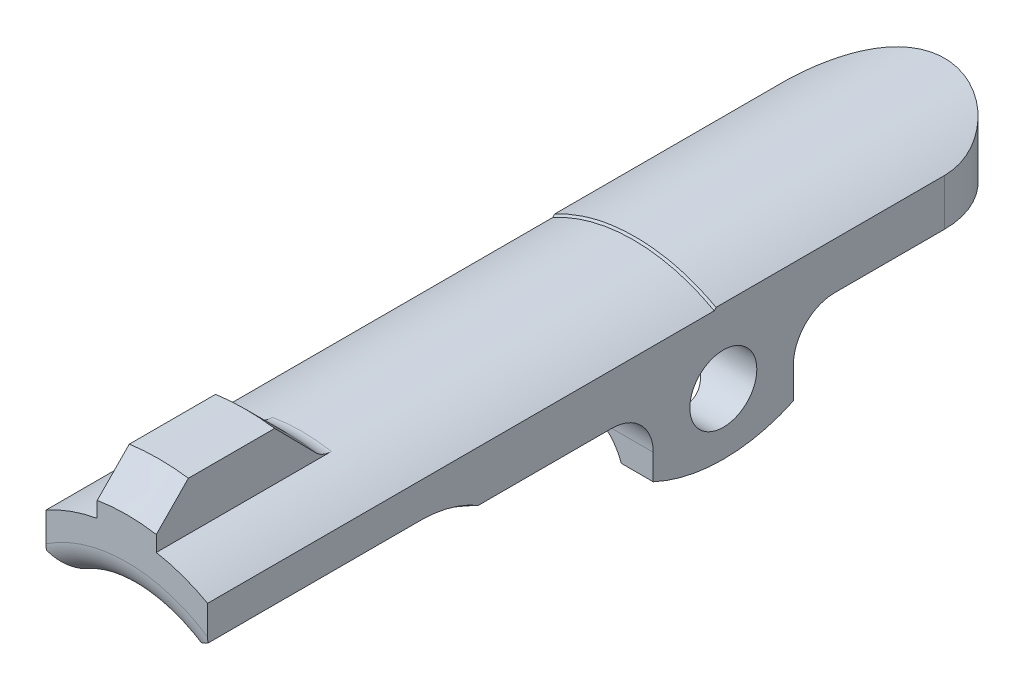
ISO-10303-21;
HEADER;
FILE_DESCRIPTION(('STEP AP214'),'2;1');
FILE_NAME('part.step','',(''),(''),'','','');
FILE_SCHEMA(('AUTOMOTIVE_DESIGN { 1 0 10303 214 1 1 1 1 }'));
ENDSEC;
DATA;
#1=APPLICATION_CONTEXT('core data for automotive mechanical design processes');
#2=APPLICATION_PROTOCOL_DEFINITION('international standard','automotive_design',2000,#1);
#3=PRODUCT_CONTEXT('',#1,'mechanical');
#4=PRODUCT('Part','Part','',(#3));
#5=PRODUCT_RELATED_PRODUCT_CATEGORY('part','',(#4));
#6=PRODUCT_DEFINITION_FORMATION('','',#4);
#7=PRODUCT_DEFINITION_CONTEXT('part definition',#1,'design');
#8=PRODUCT_DEFINITION('design','',#6,#7);
#9=PRODUCT_DEFINITION_SHAPE('','',#8);
#10=(LENGTH_UNIT() NAMED_UNIT(*) SI_UNIT(.MILLI.,.METRE.));
#11=(NAMED_UNIT(*) PLANE_ANGLE_UNIT() SI_UNIT($,.RADIAN.));
#12=(NAMED_UNIT(*) SI_UNIT($,.STERADIAN.) SOLID_ANGLE_UNIT());
#13=UNCERTAINTY_MEASURE_WITH_UNIT(LENGTH_MEASURE(1.E-05),#10,'distance_accuracy_value','');
#14=(GEOMETRIC_REPRESENTATION_CONTEXT(3) GLOBAL_UNCERTAINTY_ASSIGNED_CONTEXT((#13)) GLOBAL_UNIT_ASSIGNED_CONTEXT((#10,
#11,#12)) REPRESENTATION_CONTEXT('',''));
#15=CARTESIAN_POINT('',(0.,0.,0.));
#16=DIRECTION('',(0.,0.,1.));
#17=DIRECTION('',(1.,0.,0.));
#18=AXIS2_PLACEMENT_3D('',#15,#16,#17);
#19=CARTESIAN_POINT('',(-3.1,0.,-19.52));
#20=DIRECTION('',(-1.,0.,0.));
#21=DIRECTION('',(0.,-1.,0.));
#22=AXIS2_PLACEMENT_3D('',#19,#20,#21);
#23=PLANE('',#22);
#24=DIRECTION('',(0.,0.,1.));
#25=VECTOR('',#24,1.);
#26=CARTESIAN_POINT('',(-3.1,0.61,-13.18));
#27=LINE('',#26,#25);
#28=CARTESIAN_POINT('',(-3.1,0.61,-1.5));
#29=VERTEX_POINT('',#28);
#30=CARTESIAN_POINT('',(-3.1,0.61,-0.0122836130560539));
#31=VERTEX_POINT('',#30);
#32=EDGE_CURVE('E672',#29,#31,#27,.T.);
#33=ORIENTED_EDGE('',*,*,#32,.T.);
#34=CARTESIAN_POINT('',(-3.1,0.61,-0.0122836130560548));
#35=CARTESIAN_POINT('',(-3.1,0.644483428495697,-0.00820335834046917));
#36=CARTESIAN_POINT('',(-3.1,0.679026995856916,-0.00513959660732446));
#37=CARTESIAN_POINT('',(-3.1,0.748234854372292,-0.00104503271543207));
#38=CARTESIAN_POINT('',(-3.1,0.782899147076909,-1.42567632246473E-05));
#39=CARTESIAN_POINT('',(-3.1,0.817623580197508,0.));
#40=B_SPLINE_CURVE_WITH_KNOTS('',3,(#34,#35,#36,#37,#38,#39),.UNSPECIFIED.,.F.,.F.,(4,2,4),(0.,
0.104037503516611,0.208076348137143),.UNSPECIFIED.);
#41=CARTESIAN_POINT('',(-3.1,0.817623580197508,0.));
#42=VERTEX_POINT('',#41);
#43=EDGE_CURVE('E342',#31,#42,#40,.T.);
#44=ORIENTED_EDGE('',*,*,#43,.T.);
#45=DIRECTION('',(0.,-1.,0.));
#46=VECTOR('',#45,1.);
#47=CARTESIAN_POINT('',(-3.1,0.,0.));
#48=LINE('',#47,#46);
#49=CARTESIAN_POINT('',(-3.1,1.94,0.));
#50=VERTEX_POINT('',#49);
#51=EDGE_CURVE('E471',#50,#42,#48,.T.);
#52=ORIENTED_EDGE('',*,*,#51,.F.);
#53=DIRECTION('',(0.,0.,1.));
#54=VECTOR('',#53,1.);
#55=CARTESIAN_POINT('',(-3.1,1.94,-19.52));
#56=LINE('',#55,#54);
#57=CARTESIAN_POINT('',(-3.1,1.94,-19.44));
#58=VERTEX_POINT('',#57);
#59=EDGE_CURVE('E444',#58,#50,#56,.T.);
#60=ORIENTED_EDGE('',*,*,#59,.F.);
#61=CARTESIAN_POINT('',(-3.1,1.94,-19.44));
#62=CARTESIAN_POINT('',(-3.1,1.95334309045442,-19.4516451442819));
#63=CARTESIAN_POINT('',(-3.1,1.96668130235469,-19.4632958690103));
#64=CARTESIAN_POINT('',(-3.1,1.99334796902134,-19.4866084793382));
#65=CARTESIAN_POINT('',(-3.1,2.00667642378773,-19.4982703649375));
#66=CARTESIAN_POINT('',(-3.1,2.02,-19.5099378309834));
#67=B_SPLINE_CURVE_WITH_KNOTS('',3,(#61,#62,#63,#64,#65,#66),.UNSPECIFIED.,.F.,.F.,(4,2,4),(0.,
0.0531302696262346,0.106260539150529),.UNSPECIFIED.);
#68=CARTESIAN_POINT('',(-3.1,2.02,-19.5099378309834));
#69=VERTEX_POINT('',#68);
#70=EDGE_CURVE('E706',#58,#69,#67,.T.);
#71=ORIENTED_EDGE('',*,*,#70,.T.);
#72=DIRECTION('',(0.,0.,1.));
#73=VECTOR('',#72,1.);
#74=CARTESIAN_POINT('',(-3.1,2.02,-31.38));
#75=LINE('',#74,#73);
#76=CARTESIAN_POINT('',(-3.1,2.02,-28.28));
#77=VERTEX_POINT('',#76);
#78=EDGE_CURVE('E458',#77,#69,#75,.T.);
#79=ORIENTED_EDGE('',*,*,#78,.F.);
#80=DIRECTION('',(0.,-1.,0.));
#81=VECTOR('',#80,1.);
#82=CARTESIAN_POINT('',(-3.1,2.81762623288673,-28.28));
#83=LINE('',#82,#81);
#84=CARTESIAN_POINT('',(-3.1,0.23,-28.28));
#85=VERTEX_POINT('',#84);
#86=EDGE_CURVE('E476',#77,#85,#83,.T.);
#87=ORIENTED_EDGE('',*,*,#86,.T.);
#88=DIRECTION('',(0.,0.,1.));
#89=VECTOR('',#88,1.);
#90=CARTESIAN_POINT('',(-3.1,0.23,-31.38));
#91=LINE('',#90,#89);
#92=CARTESIAN_POINT('',(-3.1,0.23,-24.07));
#93=VERTEX_POINT('',#92);
#94=EDGE_CURVE('E454',#85,#93,#91,.T.);
#95=ORIENTED_EDGE('',*,*,#94,.T.);
#96=CARTESIAN_POINT('',(-3.1,-1.36,-24.07));
#97=DIRECTION('',(-1.,0.,0.));
#98=DIRECTION('',(0.,-1.,0.));
#99=AXIS2_PLACEMENT_3D('',#96,#97,#98);
#100=CIRCLE('',#99,1.59);
#101=CARTESIAN_POINT('',(-3.1,-1.36,-22.48));
#102=VERTEX_POINT('',#101);
#103=EDGE_CURVE('E759',#93,#102,#100,.F.);
#104=ORIENTED_EDGE('',*,*,#103,.T.);
#105=DIRECTION('',(0.,1.,0.));
#106=VECTOR('',#105,1.);
#107=CARTESIAN_POINT('',(-3.1,-3.17,-22.48));
#108=LINE('',#107,#106);
#109=CARTESIAN_POINT('',(-3.1,-2.5720778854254,-22.48));
#110=VERTEX_POINT('',#109);
#111=EDGE_CURVE('E588',#110,#102,#108,.T.);
#112=ORIENTED_EDGE('',*,*,#111,.F.);
#113=CARTESIAN_POINT('',(-3.1,3.18000000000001,-19.79));
#114=DIRECTION('',(-1.,0.,0.));
#115=DIRECTION('',(0.,-1.,0.));
#116=AXIS2_PLACEMENT_3D('',#113,#114,#115);
#117=CIRCLE('',#116,6.35);
#118=CARTESIAN_POINT('',(-3.1,-2.5720778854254,-17.1));
#119=VERTEX_POINT('',#118);
#120=EDGE_CURVE('E615',#110,#119,#117,.T.);
#121=ORIENTED_EDGE('',*,*,#120,.T.);
#122=DIRECTION('',(0.,1.,0.));
#123=VECTOR('',#122,1.);
#124=CARTESIAN_POINT('',(-3.1,-3.17,-17.1));
#125=LINE('',#124,#123);
#126=CARTESIAN_POINT('',(-3.1,-1.59,-17.1));
#127=VERTEX_POINT('',#126);
#128=EDGE_CURVE('E591',#119,#127,#125,.T.);
#129=ORIENTED_EDGE('',*,*,#128,.T.);
#130=CARTESIAN_POINT('',(-3.1,-1.59,-15.51));
#131=DIRECTION('',(-1.,0.,0.));
#132=DIRECTION('',(0.,-1.,0.));
#133=AXIS2_PLACEMENT_3D('',#130,#131,#132);
#134=CIRCLE('',#133,1.59);
#135=CARTESIAN_POINT('',(-3.1,0.,-15.51));
#136=VERTEX_POINT('',#135);
#137=EDGE_CURVE('E764',#127,#136,#134,.F.);
#138=ORIENTED_EDGE('',*,*,#137,.T.);
#139=DIRECTION('',(0.,0.,1.));
#140=VECTOR('',#139,1.);
#141=CARTESIAN_POINT('',(-3.1,0.,-19.52));
#142=LINE('',#141,#140);
#143=CARTESIAN_POINT('',(-3.1,0.,-10.389856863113));
#144=VERTEX_POINT('',#143);
#145=EDGE_CURVE('E462',#136,#144,#142,.T.);
#146=ORIENTED_EDGE('',*,*,#145,.T.);
#147=CARTESIAN_POINT('',(-3.09999999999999,-5.31400696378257,-8.18));
#148=DIRECTION('',(-1.,0.,0.));
#149=DIRECTION('',(0.,-1.,0.));
#150=AXIS2_PLACEMENT_3D('',#147,#148,#149);
#151=ELLIPSE('',#150,5.92400696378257,5.);
#152=CARTESIAN_POINT('',(-3.1,0.61,-8.18));
#153=VERTEX_POINT('',#152);
#154=EDGE_CURVE('E331',#144,#153,#151,.F.);
#155=ORIENTED_EDGE('',*,*,#154,.T.);
#156=CARTESIAN_POINT('',(-3.1,0.61,-3.07));
#157=VERTEX_POINT('',#156);
#158=EDGE_CURVE('E670',#153,#157,#27,.T.);
#159=ORIENTED_EDGE('',*,*,#158,.T.);
#160=DIRECTION('',(0.,1.,0.));
#161=VECTOR('',#160,1.);
#162=CARTESIAN_POINT('',(-3.1,0.,-3.07));
#163=LINE('',#162,#161);
#164=CARTESIAN_POINT('',(-3.1,0.611885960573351,-3.07));
#165=VERTEX_POINT('',#164);
#166=EDGE_CURVE('E648',#157,#165,#163,.T.);
#167=ORIENTED_EDGE('',*,*,#166,.T.);
#168=DIRECTION('',(0.,0.,1.));
#169=VECTOR('',#168,1.);
#170=CARTESIAN_POINT('',(-3.1,0.611885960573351,-3.07));
#171=LINE('',#170,#169);
#172=CARTESIAN_POINT('',(-3.1,0.611885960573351,-1.5));
#173=VERTEX_POINT('',#172);
#174=EDGE_CURVE('E645',#173,#165,#171,.F.);
#175=ORIENTED_EDGE('',*,*,#174,.F.);
#176=DIRECTION('',(0.,1.,0.));
#177=VECTOR('',#176,1.);
#178=CARTESIAN_POINT('',(-3.1,0.,-1.5));
#179=LINE('',#178,#177);
#180=EDGE_CURVE('E652',#29,#173,#179,.T.);
#181=ORIENTED_EDGE('',*,*,#180,.F.);
#182=EDGE_LOOP('',(#33,#44,#52,#60,#71,#79,#87,#95,#104,#112,#121,#129,#138,#146,#155,#159,#167,
#175,#181));
#183=FACE_BOUND('',#182,.T.);
#184=CARTESIAN_POINT('',(-3.1,-0.82,-19.79));
#185=DIRECTION('',(-1.,0.,0.));
#186=DIRECTION('',(0.,-1.,0.));
#187=AXIS2_PLACEMENT_3D('',#184,#185,#186);
#188=CIRCLE('',#187,1.285);
#189=CARTESIAN_POINT('',(-3.1,-2.105,-19.79));
#190=VERTEX_POINT('',#189);
#191=EDGE_CURVE('E566',#190,#190,#188,.T.);
#192=ORIENTED_EDGE('',*,*,#191,.F.);
#193=EDGE_LOOP('',(#192));
#194=FACE_BOUND('',#193,.T.);
#195=ADVANCED_FACE('F55',(#183,#194),#23,.T.);
#196=CARTESIAN_POINT('',(3.1,0.,-19.52));
#197=DIRECTION('',(1.,0.,0.));
#198=DIRECTION('',(0.,1.,0.));
#199=AXIS2_PLACEMENT_3D('',#196,#197,#198);
#200=PLANE('',#199);
#201=DIRECTION('',(0.,1.,0.));
#202=VECTOR('',#201,1.);
#203=CARTESIAN_POINT('',(3.1,0.,0.));
#204=LINE('',#203,#202);
#205=CARTESIAN_POINT('',(3.1,0.817623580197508,0.));
#206=VERTEX_POINT('',#205);
#207=CARTESIAN_POINT('',(3.1,1.94,0.));
#208=VERTEX_POINT('',#207);
#209=EDGE_CURVE('E469',#206,#208,#204,.T.);
#210=ORIENTED_EDGE('',*,*,#209,.F.);
#211=CARTESIAN_POINT('',(3.1,0.817623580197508,0.));
#212=CARTESIAN_POINT('',(3.1,0.78289914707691,-1.42567632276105E-05));
#213=CARTESIAN_POINT('',(3.1,0.748234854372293,-0.00104503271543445));
#214=CARTESIAN_POINT('',(3.1,0.679026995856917,-0.00513959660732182));
#215=CARTESIAN_POINT('',(3.1,0.644483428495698,-0.00820335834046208));
#216=CARTESIAN_POINT('',(3.1,0.61,-0.0122836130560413));
#217=B_SPLINE_CURVE_WITH_KNOTS('',3,(#211,#212,#213,#214,#215,#216),.UNSPECIFIED.,.F.,.F.,(4,2,
4),(0.,0.104038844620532,0.208076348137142),.UNSPECIFIED.);
#218=CARTESIAN_POINT('',(3.1,0.61,-0.0122836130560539));
#219=VERTEX_POINT('',#218);
#220=EDGE_CURVE('E70',#206,#219,#217,.T.);
#221=ORIENTED_EDGE('',*,*,#220,.T.);
#222=DIRECTION('',(0.,0.,1.));
#223=VECTOR('',#222,1.);
#224=CARTESIAN_POINT('',(3.1,0.61,-13.18));
#225=LINE('',#224,#223);
#226=CARTESIAN_POINT('',(3.1,0.61,-1.5));
#227=VERTEX_POINT('',#226);
#228=EDGE_CURVE('E284',#227,#219,#225,.T.);
#229=ORIENTED_EDGE('',*,*,#228,.F.);
#230=DIRECTION('',(0.,-1.,0.));
#231=VECTOR('',#230,1.);
#232=CARTESIAN_POINT('',(3.1,0.,-1.5));
#233=LINE('',#232,#231);
#234=CARTESIAN_POINT('',(3.1,0.611885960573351,-1.5));
#235=VERTEX_POINT('',#234);
#236=EDGE_CURVE('E654',#235,#227,#233,.T.);
#237=ORIENTED_EDGE('',*,*,#236,.F.);
#238=DIRECTION('',(0.,0.,1.));
#239=VECTOR('',#238,1.);
#240=CARTESIAN_POINT('',(3.1,0.61188596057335,-3.07));
#241=LINE('',#240,#239);
#242=CARTESIAN_POINT('',(3.1,0.611885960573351,-3.07));
#243=VERTEX_POINT('',#242);
#244=EDGE_CURVE('E301',#243,#235,#241,.T.);
#245=ORIENTED_EDGE('',*,*,#244,.F.);
#246=DIRECTION('',(0.,-1.,0.));
#247=VECTOR('',#246,1.);
#248=CARTESIAN_POINT('',(3.1,0.,-3.07));
#249=LINE('',#248,#247);
#250=CARTESIAN_POINT('',(3.1,0.61,-3.07));
#251=VERTEX_POINT('',#250);
#252=EDGE_CURVE('E650',#243,#251,#249,.T.);
#253=ORIENTED_EDGE('',*,*,#252,.T.);
#254=CARTESIAN_POINT('',(3.1,0.61,-8.18));
#255=VERTEX_POINT('',#254);
#256=EDGE_CURVE('E291',#255,#251,#225,.T.);
#257=ORIENTED_EDGE('',*,*,#256,.F.);
#258=CARTESIAN_POINT('',(3.09999999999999,-5.31400696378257,-8.18));
#259=DIRECTION('',(1.,0.,0.));
#260=DIRECTION('',(0.,1.,0.));
#261=AXIS2_PLACEMENT_3D('',#258,#259,#260);
#262=ELLIPSE('',#261,5.92400696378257,5.);
#263=CARTESIAN_POINT('',(3.1,0.,-10.389856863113));
#264=VERTEX_POINT('',#263);
#265=EDGE_CURVE('E325',#255,#264,#262,.F.);
#266=ORIENTED_EDGE('',*,*,#265,.T.);
#267=DIRECTION('',(0.,0.,1.));
#268=VECTOR('',#267,1.);
#269=CARTESIAN_POINT('',(3.1,0.,-19.52));
#270=LINE('',#269,#268);
#271=CARTESIAN_POINT('',(3.1,0.,-15.51));
#272=VERTEX_POINT('',#271);
#273=EDGE_CURVE('E445',#272,#264,#270,.T.);
#274=ORIENTED_EDGE('',*,*,#273,.F.);
#275=CARTESIAN_POINT('',(3.1,-1.59,-15.51));
#276=DIRECTION('',(1.,0.,0.));
#277=DIRECTION('',(0.,1.,0.));
#278=AXIS2_PLACEMENT_3D('',#275,#276,#277);
#279=CIRCLE('',#278,1.59);
#280=CARTESIAN_POINT('',(3.1,-1.59,-17.1));
#281=VERTEX_POINT('',#280);
#282=EDGE_CURVE('E760',#272,#281,#279,.F.);
#283=ORIENTED_EDGE('',*,*,#282,.T.);
#284=DIRECTION('',(0.,1.,0.));
#285=VECTOR('',#284,1.);
#286=CARTESIAN_POINT('',(3.1,-3.17,-17.1));
#287=LINE('',#286,#285);
#288=CARTESIAN_POINT('',(3.1,-2.57207788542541,-17.1));
#289=VERTEX_POINT('',#288);
#290=EDGE_CURVE('E589',#289,#281,#287,.T.);
#291=ORIENTED_EDGE('',*,*,#290,.F.);
#292=CARTESIAN_POINT('',(3.1,3.18,-19.79));
#293=DIRECTION('',(1.,0.,0.));
#294=DIRECTION('',(0.,1.,0.));
#295=AXIS2_PLACEMENT_3D('',#292,#293,#294);
#296=CIRCLE('',#295,6.35);
#297=CARTESIAN_POINT('',(3.1,-2.57207788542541,-22.48));
#298=VERTEX_POINT('',#297);
#299=EDGE_CURVE('E579',#289,#298,#296,.T.);
#300=ORIENTED_EDGE('',*,*,#299,.T.);
#301=DIRECTION('',(0.,1.,0.));
#302=VECTOR('',#301,1.);
#303=CARTESIAN_POINT('',(3.1,-3.17,-22.48));
#304=LINE('',#303,#302);
#305=CARTESIAN_POINT('',(3.1,-1.36,-22.48));
#306=VERTEX_POINT('',#305);
#307=EDGE_CURVE('E584',#298,#306,#304,.T.);
#308=ORIENTED_EDGE('',*,*,#307,.T.);
#309=CARTESIAN_POINT('',(3.1,-1.36,-24.07));
#310=DIRECTION('',(1.,0.,0.));
#311=DIRECTION('',(0.,1.,0.));
#312=AXIS2_PLACEMENT_3D('',#309,#310,#311);
#313=CIRCLE('',#312,1.59);
#314=CARTESIAN_POINT('',(3.1,0.23,-24.07));
#315=VERTEX_POINT('',#314);
#316=EDGE_CURVE('E757',#306,#315,#313,.F.);
#317=ORIENTED_EDGE('',*,*,#316,.T.);
#318=DIRECTION('',(0.,0.,1.));
#319=VECTOR('',#318,1.);
#320=CARTESIAN_POINT('',(3.1,0.23,-31.38));
#321=LINE('',#320,#319);
#322=CARTESIAN_POINT('',(3.1,0.23,-28.28));
#323=VERTEX_POINT('',#322);
#324=EDGE_CURVE('E457',#323,#315,#321,.T.);
#325=ORIENTED_EDGE('',*,*,#324,.F.);
#326=DIRECTION('',(0.,-1.,0.));
#327=VECTOR('',#326,1.);
#328=CARTESIAN_POINT('',(3.1,2.81762623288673,-28.28));
#329=LINE('',#328,#327);
#330=CARTESIAN_POINT('',(3.1,2.02,-28.28));
#331=VERTEX_POINT('',#330);
#332=EDGE_CURVE('E489',#331,#323,#329,.T.);
#333=ORIENTED_EDGE('',*,*,#332,.F.);
#334=DIRECTION('',(0.,0.,1.));
#335=VECTOR('',#334,1.);
#336=CARTESIAN_POINT('',(3.1,2.02,-31.38));
#337=LINE('',#336,#335);
#338=CARTESIAN_POINT('',(3.1,2.02,-19.5099378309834));
#339=VERTEX_POINT('',#338);
#340=EDGE_CURVE('E474',#331,#339,#337,.T.);
#341=ORIENTED_EDGE('',*,*,#340,.T.);
#342=CARTESIAN_POINT('',(3.1,2.02,-19.5099378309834));
#343=CARTESIAN_POINT('',(3.1,2.00667642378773,-19.4982703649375));
#344=CARTESIAN_POINT('',(3.1,1.99334796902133,-19.4866084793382));
#345=CARTESIAN_POINT('',(3.1,1.96668130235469,-19.4632958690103));
#346=CARTESIAN_POINT('',(3.1,1.95334309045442,-19.4516451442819));
#347=CARTESIAN_POINT('',(3.1,1.94,-19.44));
#348=B_SPLINE_CURVE_WITH_KNOTS('',3,(#342,#343,#344,#345,#346,#347),.UNSPECIFIED.,.F.,.F.,(4,2,
4),(0.,0.0531302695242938,0.106260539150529),.UNSPECIFIED.);
#349=CARTESIAN_POINT('',(3.1,1.94,-19.44));
#350=VERTEX_POINT('',#349);
#351=EDGE_CURVE('E302',#339,#350,#348,.T.);
#352=ORIENTED_EDGE('',*,*,#351,.T.);
#353=DIRECTION('',(0.,0.,1.));
#354=VECTOR('',#353,1.);
#355=CARTESIAN_POINT('',(3.1,1.94,-19.52));
#356=LINE('',#355,#354);
#357=EDGE_CURVE('E440',#350,#208,#356,.T.);
#358=ORIENTED_EDGE('',*,*,#357,.T.);
#359=EDGE_LOOP('',(#210,#221,#229,#237,#245,#253,#257,#266,#274,#283,#291,#300,#308,#317,#325,
#333,#341,#352,#358));
#360=FACE_BOUND('',#359,.T.);
#361=CARTESIAN_POINT('',(3.1,-0.819999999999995,-19.79));
#362=DIRECTION('',(1.,0.,0.));
#363=DIRECTION('',(0.,1.,0.));
#364=AXIS2_PLACEMENT_3D('',#361,#362,#363);
#365=CIRCLE('',#364,1.285);
#366=CARTESIAN_POINT('',(3.1,0.465000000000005,-19.79));
#367=VERTEX_POINT('',#366);
#368=EDGE_CURVE('E565',#367,#367,#365,.T.);
#369=ORIENTED_EDGE('',*,*,#368,.F.);
#370=EDGE_LOOP('',(#369));
#371=FACE_BOUND('',#370,.T.);
#372=ADVANCED_FACE('F694',(#360,#371),#200,.T.);
#373=CARTESIAN_POINT('',(-3.1,0.,-19.52));
#374=DIRECTION('',(0.,-1.,0.));
#375=DIRECTION('',(1.,0.,0.));
#376=AXIS2_PLACEMENT_3D('',#373,#374,#375);
#377=PLANE('',#376);
#378=ORIENTED_EDGE('',*,*,#273,.T.);
#379=CARTESIAN_POINT('',(11.4630273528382,0.,-8.18));
#380=DIRECTION('',(0.,-1.,0.));
#381=DIRECTION('',(1.,0.,0.));
#382=AXIS2_PLACEMENT_3D('',#379,#380,#381);
#383=ELLIPSE('',#382,9.32302735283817,5.);
#384=CARTESIAN_POINT('',(2.14,0.,-8.18));
#385=VERTEX_POINT('',#384);
#386=EDGE_CURVE('E280',#264,#385,#383,.F.);
#387=ORIENTED_EDGE('',*,*,#386,.T.);
#388=DIRECTION('',(0.,0.,1.));
#389=VECTOR('',#388,1.);
#390=CARTESIAN_POINT('',(2.14,0.,-13.18));
#391=LINE('',#390,#389);
#392=CARTESIAN_POINT('',(2.14,0.,-3.07));
#393=VERTEX_POINT('',#392);
#394=EDGE_CURVE('E272',#385,#393,#391,.T.);
#395=ORIENTED_EDGE('',*,*,#394,.T.);
#396=DIRECTION('',(-1.,0.,0.));
#397=VECTOR('',#396,1.);
#398=CARTESIAN_POINT('',(-3.1,0.,-3.07));
#399=LINE('',#398,#397);
#400=CARTESIAN_POINT('',(-2.14,0.,-3.07));
#401=VERTEX_POINT('',#400);
#402=EDGE_CURVE('E277',#393,#401,#399,.T.);
#403=ORIENTED_EDGE('',*,*,#402,.T.);
#404=DIRECTION('',(0.,0.,1.));
#405=VECTOR('',#404,1.);
#406=CARTESIAN_POINT('',(-2.14,0.,-13.18));
#407=LINE('',#406,#405);
#408=CARTESIAN_POINT('',(-2.14,0.,-8.18));
#409=VERTEX_POINT('',#408);
#410=EDGE_CURVE('E294',#409,#401,#407,.T.);
#411=ORIENTED_EDGE('',*,*,#410,.F.);
#412=CARTESIAN_POINT('',(-11.4630273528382,0.,-8.18));
#413=DIRECTION('',(0.,-1.,0.));
#414=DIRECTION('',(1.,0.,0.));
#415=AXIS2_PLACEMENT_3D('',#412,#413,#414);
#416=ELLIPSE('',#415,9.32302735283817,5.);
#417=EDGE_CURVE('E328',#409,#144,#416,.F.);
#418=ORIENTED_EDGE('',*,*,#417,.T.);
#419=ORIENTED_EDGE('',*,*,#145,.F.);
#420=DIRECTION('',(1.,0.,0.));
#421=VECTOR('',#420,1.);
#422=CARTESIAN_POINT('',(-3.1,0.,-15.51));
#423=LINE('',#422,#421);
#424=EDGE_CURVE('E774',#136,#272,#423,.T.);
#425=ORIENTED_EDGE('',*,*,#424,.T.);
#426=EDGE_LOOP('',(#378,#387,#395,#403,#411,#418,#419,#425));
#427=FACE_BOUND('',#426,.T.);
#428=ADVANCED_FACE('F274',(#427),#377,.T.);
#429=CARTESIAN_POINT('',(0.,-3.60188596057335,-19.52));
#430=DIRECTION('',(0.,0.,1.));
#431=DIRECTION('',(1.,0.,0.));
#432=AXIS2_PLACEMENT_3D('',#429,#430,#431);
#433=CYLINDRICAL_SURFACE('',#432,6.35);
#434=ORIENTED_EDGE('',*,*,#357,.F.);
#435=CARTESIAN_POINT('',(0.,-3.60188596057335,-19.44));
#436=DIRECTION('',(0.,0.,1.));
#437=DIRECTION('',(1.,0.,0.));
#438=AXIS2_PLACEMENT_3D('',#435,#436,#437);
#439=CIRCLE('',#438,6.35);
#440=EDGE_CURVE('E439',#350,#58,#439,.T.);
#441=ORIENTED_EDGE('',*,*,#440,.T.);
#442=ORIENTED_EDGE('',*,*,#59,.T.);
#443=CARTESIAN_POINT('',(0.,-3.60188596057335,0.));
#444=DIRECTION('',(0.,0.,1.));
#445=DIRECTION('',(1.,0.,0.));
#446=AXIS2_PLACEMENT_3D('',#443,#444,#445);
#447=CIRCLE('',#446,6.35);
#448=CARTESIAN_POINT('',(-1.13368418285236,2.64609452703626,0.));
#449=VERTEX_POINT('',#448);
#450=EDGE_CURVE('E468',#449,#50,#447,.T.);
#451=ORIENTED_EDGE('',*,*,#450,.F.);
#452=DIRECTION('',(0.,0.,1.));
#453=VECTOR('',#452,1.);
#454=CARTESIAN_POINT('',(-1.13368418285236,2.64609452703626,-6.44));
#455=LINE('',#454,#453);
#456=CARTESIAN_POINT('',(-1.13368418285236,2.64609452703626,-6.7179393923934));
#457=VERTEX_POINT('',#456);
#458=EDGE_CURVE('E638',#457,#449,#455,.T.);
#459=ORIENTED_EDGE('',*,*,#458,.F.);
#460=CARTESIAN_POINT('',(0.,-3.60188596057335,-6.7179393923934));
#461=DIRECTION('',(0.,0.,-1.));
#462=DIRECTION('',(-1.,0.,0.));
#463=AXIS2_PLACEMENT_3D('',#460,#461,#462);
#464=CIRCLE('',#463,6.35);
#465=CARTESIAN_POINT('',(1.13368418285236,2.64609452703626,-6.7179393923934));
#466=VERTEX_POINT('',#465);
#467=EDGE_CURVE('E1096',#457,#466,#464,.T.);
#468=ORIENTED_EDGE('',*,*,#467,.T.);
#469=DIRECTION('',(0.,0.,1.));
#470=VECTOR('',#469,1.);
#471=CARTESIAN_POINT('',(1.13368418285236,2.64609452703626,-6.44));
#472=LINE('',#471,#470);
#473=CARTESIAN_POINT('',(1.13368418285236,2.64609452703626,0.));
#474=VERTEX_POINT('',#473);
#475=EDGE_CURVE('E632',#466,#474,#472,.T.);
#476=ORIENTED_EDGE('',*,*,#475,.T.);
#477=EDGE_CURVE('E464',#208,#474,#447,.T.);
#478=ORIENTED_EDGE('',*,*,#477,.F.);
#479=EDGE_LOOP('',(#434,#441,#442,#451,#459,#468,#476,#478));
#480=FACE_BOUND('',#479,.T.);
#481=ADVANCED_FACE('F510',(#480),#433,.T.);
#482=CARTESIAN_POINT('',(0.,-3.21,-31.381));
#483=DIRECTION('',(0.,0.,1.));
#484=DIRECTION('',(1.,0.,0.));
#485=AXIS2_PLACEMENT_3D('',#482,#483,#484);
#486=CYLINDRICAL_SURFACE('',#485,1.98);
#487=CARTESIAN_POINT('',(1.64297748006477,-2.105,-19.79));
#488=CARTESIAN_POINT('',(1.64297824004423,-2.10499660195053,-19.7302139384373));
#489=CARTESIAN_POINT('',(1.64017916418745,-2.10080357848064,-19.6703767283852));
#490=CARTESIAN_POINT('',(1.62885303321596,-2.08424038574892,-19.5523401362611));
#491=CARTESIAN_POINT('',(1.62031807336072,-2.07185893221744,-19.4941431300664));
#492=CARTESIAN_POINT('',(1.59719196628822,-2.03962874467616,-19.3811238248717));
#493=CARTESIAN_POINT('',(1.58260236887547,-2.01978192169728,-19.326300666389));
#494=CARTESIAN_POINT('',(1.54700396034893,-1.97387015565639,-19.2216034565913));
#495=CARTESIAN_POINT('',(1.52599858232,-1.94780853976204,-19.1717267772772));
#496=CARTESIAN_POINT('',(1.47744681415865,-1.89131644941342,-19.0783298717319));
#497=CARTESIAN_POINT('',(1.44992638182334,-1.86090349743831,-19.0347854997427));
#498=CARTESIAN_POINT('',(1.3884242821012,-1.7976900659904,-18.9545605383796));
#499=CARTESIAN_POINT('',(1.35444198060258,-1.76488935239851,-18.9178806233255));
#500=CARTESIAN_POINT('',(1.27895556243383,-1.69760811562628,-18.8501019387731));
#501=CARTESIAN_POINT('',(1.23719506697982,-1.66311499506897,-18.819303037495));
#502=CARTESIAN_POINT('',(1.14807294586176,-1.59585724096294,-18.7647438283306));
#503=CARTESIAN_POINT('',(1.10070706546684,-1.56309394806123,-18.7409889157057));
#504=CARTESIAN_POINT('',(0.981373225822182,-1.48836314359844,-18.6912397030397));
#505=CARTESIAN_POINT('',(0.907172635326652,-1.44799388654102,-18.6681876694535));
#506=CARTESIAN_POINT('',(0.752341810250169,-1.37650727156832,-18.6310543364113));
#507=CARTESIAN_POINT('',(0.671701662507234,-1.34540454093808,-18.6169871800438));
#508=CARTESIAN_POINT('',(0.505093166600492,-1.29349037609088,-18.5950793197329));
#509=CARTESIAN_POINT('',(0.419064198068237,-1.27283589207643,-18.5873325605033));
#510=CARTESIAN_POINT('',(0.244739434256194,-1.24319628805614,-18.5765822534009));
#511=CARTESIAN_POINT('',(0.156443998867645,-1.23420932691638,-18.5735779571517));
#512=CARTESIAN_POINT('',(0.0165862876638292,-1.22940006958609,-18.5719645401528));
#513=CARTESIAN_POINT('',(-0.0348619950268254,-1.22963894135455,-18.5720410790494));
#514=CARTESIAN_POINT('',(-0.137560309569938,-1.23411655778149,-18.5735540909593));
#515=CARTESIAN_POINT('',(-0.188810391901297,-1.2383542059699,-18.5749901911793));
#516=CARTESIAN_POINT('',(-0.290851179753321,-1.25080303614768,-18.5793486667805));
#517=CARTESIAN_POINT('',(-0.341640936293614,-1.25902108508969,-18.5822736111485));
#518=CARTESIAN_POINT('',(-0.442283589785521,-1.27934751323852,-18.5898572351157));
#519=CARTESIAN_POINT('',(-0.492136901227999,-1.29145412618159,-18.5945151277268));
#520=CARTESIAN_POINT('',(-0.591335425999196,-1.3196499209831,-18.6060191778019));
#521=CARTESIAN_POINT('',(-0.640659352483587,-1.33580039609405,-18.6128995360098));
#522=CARTESIAN_POINT('',(-0.737516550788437,-1.3717568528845,-18.6293191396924));
#523=CARTESIAN_POINT('',(-0.785049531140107,-1.39156342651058,-18.6388588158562));
#524=CARTESIAN_POINT('',(-0.87769526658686,-1.43443048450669,-18.6611590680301));
#525=CARTESIAN_POINT('',(-0.922814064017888,-1.45748226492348,-18.6739110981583));
#526=CARTESIAN_POINT('',(-1.01017861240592,-1.50634364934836,-18.7032759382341));
#527=CARTESIAN_POINT('',(-1.05242618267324,-1.53215147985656,-18.7198862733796));
#528=CARTESIAN_POINT('',(-1.14565600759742,-1.59387835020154,-18.7632801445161));
#529=CARTESIAN_POINT('',(-1.19546629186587,-1.63051124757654,-18.7916205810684));
#530=CARTESIAN_POINT('',(-1.28795638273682,-1.70497715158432,-18.8570019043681));
#531=CARTESIAN_POINT('',(-1.33064233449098,-1.74280909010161,-18.8940352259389));
#532=CARTESIAN_POINT('',(-1.4081766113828,-1.81703865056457,-18.9774318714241));
#533=CARTESIAN_POINT('',(-1.44297486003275,-1.85342596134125,-19.0238514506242));
#534=CARTESIAN_POINT('',(-1.50394391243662,-1.92133874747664,-19.1251769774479));
#535=CARTESIAN_POINT('',(-1.53011563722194,-1.95286474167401,-19.1800820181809));
#536=CARTESIAN_POINT('',(-1.57177492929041,-2.00545156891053,-19.2907059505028));
#537=CARTESIAN_POINT('',(-1.58808088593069,-2.02725252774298,-19.3457685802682));
#538=CARTESIAN_POINT('',(-1.61428835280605,-2.06327730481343,-19.4597615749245));
#539=CARTESIAN_POINT('',(-1.62419043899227,-2.07750180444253,-19.5186915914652));
#540=CARTESIAN_POINT('',(-1.63777926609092,-2.09724682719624,-19.6371013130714));
#541=CARTESIAN_POINT('',(-1.64161909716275,-2.10298150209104,-19.6965280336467));
#542=CARTESIAN_POINT('',(-1.64373459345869,-2.10612475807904,-19.8157001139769));
#543=CARTESIAN_POINT('',(-1.64201035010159,-2.10353347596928,-19.8754454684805));
#544=CARTESIAN_POINT('',(-1.63289727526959,-2.09012871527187,-19.9938804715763));
#545=CARTESIAN_POINT('',(-1.62547949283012,-2.07927321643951,-20.0525631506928));
#546=CARTESIAN_POINT('',(-1.60465318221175,-2.04990970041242,-20.166865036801));
#547=CARTESIAN_POINT('',(-1.59124553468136,-2.03140280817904,-20.222484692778));
#548=CARTESIAN_POINT('',(-1.55812720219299,-1.98796156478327,-20.3288675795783));
#549=CARTESIAN_POINT('',(-1.53844189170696,-1.9630531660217,-20.3796493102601));
#550=CARTESIAN_POINT('',(-1.49249810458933,-1.90841730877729,-20.4752779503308));
#551=CARTESIAN_POINT('',(-1.46624074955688,-1.87869067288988,-20.5201258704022));
#552=CARTESIAN_POINT('',(-1.40700187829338,-1.81622642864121,-20.6033169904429));
#553=CARTESIAN_POINT('',(-1.37397677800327,-1.78347009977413,-20.641614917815));
#554=CARTESIAN_POINT('',(-1.30175164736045,-1.7172701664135,-20.711107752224));
#555=CARTESIAN_POINT('',(-1.26254970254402,-1.68382635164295,-20.7423004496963));
#556=CARTESIAN_POINT('',(-1.175385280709,-1.61558230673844,-20.8001661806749));
#557=CARTESIAN_POINT('',(-1.1269737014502,-1.58088625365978,-20.8262812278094));
#558=CARTESIAN_POINT('',(-1.02496268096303,-1.5148439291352,-20.8716776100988));
#559=CARTESIAN_POINT('',(-0.971360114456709,-1.48349969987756,-20.8909547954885));
#560=CARTESIAN_POINT('',(-0.849789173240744,-1.42008907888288,-20.9269646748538));
#561=CARTESIAN_POINT('',(-0.780997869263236,-1.38896223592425,-20.9425665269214));
#562=CARTESIAN_POINT('',(-0.639365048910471,-1.33453006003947,-20.9678721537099));
#563=CARTESIAN_POINT('',(-0.566520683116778,-1.31123031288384,-20.9775717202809));
#564=CARTESIAN_POINT('',(-0.402282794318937,-1.26907104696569,-20.9942386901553));
#565=CARTESIAN_POINT('',(-0.310260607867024,-1.25223432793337,-21.0001745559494));
#566=CARTESIAN_POINT('',(-0.124545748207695,-1.23170883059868,-21.0073056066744));
#567=CARTESIAN_POINT('',(-0.0308517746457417,-1.22803077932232,-21.0084969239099));
#568=CARTESIAN_POINT('',(0.166742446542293,-1.23428739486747,-21.0063943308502));
#569=CARTESIAN_POINT('',(0.270591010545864,-1.24581853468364,-21.0025746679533));
#570=CARTESIAN_POINT('',(0.474757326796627,-1.28495842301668,-20.9881132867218));
#571=CARTESIAN_POINT('',(0.575076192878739,-1.31256205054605,-20.9774737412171));
#572=CARTESIAN_POINT('',(0.74987557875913,-1.37561535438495,-20.9490741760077));
#573=CARTESIAN_POINT('',(0.825579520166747,-1.40848481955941,-20.9331075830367));
#574=CARTESIAN_POINT('',(0.970339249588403,-1.48217021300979,-20.8920565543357));
#575=CARTESIAN_POINT('',(1.03940633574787,-1.52297226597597,-20.8669879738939));
#576=CARTESIAN_POINT('',(1.15622967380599,-1.60142544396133,-20.8110040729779));
#577=CARTESIAN_POINT('',(1.20553966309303,-1.63819730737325,-20.7821108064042));
#578=CARTESIAN_POINT('',(1.29698801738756,-1.71277105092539,-20.7155667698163));
#579=CARTESIAN_POINT('',(1.33913083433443,-1.75057227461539,-20.6779214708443));
#580=CARTESIAN_POINT('',(1.41551138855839,-1.8245118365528,-20.5933353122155));
#581=CARTESIAN_POINT('',(1.44970172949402,-1.86063922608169,-20.546341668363));
#582=CARTESIAN_POINT('',(1.50947275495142,-1.92784288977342,-20.4439507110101));
#583=CARTESIAN_POINT('',(1.53505206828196,-1.95891835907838,-20.3885520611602));
#584=CARTESIAN_POINT('',(1.57560080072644,-2.01047961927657,-20.2771953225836));
#585=CARTESIAN_POINT('',(1.59139250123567,-2.0317271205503,-20.2218844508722));
#586=CARTESIAN_POINT('',(1.61660747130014,-2.06656313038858,-20.1075880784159));
#587=CARTESIAN_POINT('',(1.62604051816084,-2.08016339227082,-20.0486083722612));
#588=CARTESIAN_POINT('',(1.63599309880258,-2.09467034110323,-19.9559663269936));
#589=CARTESIAN_POINT('',(1.63861487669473,-2.0985364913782,-19.9229514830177));
#590=CARTESIAN_POINT('',(1.64210684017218,-2.10370224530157,-19.8566297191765));
#591=CARTESIAN_POINT('',(1.64297705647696,-2.10500189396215,-19.823322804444));
#592=CARTESIAN_POINT('',(1.64297748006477,-2.105,-19.79));
#593=B_SPLINE_CURVE_WITH_KNOTS('',3,(#487,#488,#489,#490,#491,#492,#493,#494,#495,#496,#497,
#498,#499,#500,#501,#502,#503,#504,#505,#506,#507,#508,#509,#510,#511,#512,#513,#514,#515,#516,
#517,#518,#519,#520,#521,#522,#523,#524,#525,#526,#527,#528,#529,#530,#531,#532,#533,#534,#535,
#536,#537,#538,#539,#540,#541,#542,#543,#544,#545,#546,#547,#548,#549,#550,#551,#552,#553,#554,
#555,#556,#557,#558,#559,#560,#561,#562,#563,#564,#565,#566,#567,#568,#569,#570,#571,#572,#573,
#574,#575,#576,#577,#578,#579,#580,#581,#582,#583,#584,#585,#586,#587,#588,#589,#590,#591,#592),
.UNSPECIFIED.,.T.,.F.,(4,2,2,2,2,2,2,2,2,2,2,2,2,2,2,2,2,2,2,2,2,2,2,2,2,2,2,2,2,2,2,2,2,2,2,2,
2,2,2,2,2,2,2,2,2,2,2,2,2,2,2,2,4),(0.,0.179235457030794,0.358718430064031,0.538155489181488,
0.717496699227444,0.896135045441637,1.07479093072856,1.26096596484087,1.44728323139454,
1.70853993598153,1.97020687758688,2.23569573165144,2.5011426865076,2.65533921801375,
2.80949348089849,2.96391464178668,3.11826576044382,3.27511534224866,3.43199034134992,
3.58845233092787,3.74481423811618,3.94799134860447,4.15099229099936,4.35524801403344,
4.55948192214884,4.74284971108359,4.92620100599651,5.10484351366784,5.28348308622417,
5.46303708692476,5.64256469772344,5.82137566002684,6.00015612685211,6.18012631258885,
6.36015238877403,6.55451953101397,6.74900442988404,6.97947605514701,7.21011180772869,
7.49019245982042,7.77050138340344,8.08270390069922,8.39480699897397,8.64603987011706,
8.89683718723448,9.09988197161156,9.30280016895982,9.50689841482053,9.71102914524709,
9.89410253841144,10.0768937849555,10.1767955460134,10.2766955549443),.UNSPECIFIED.);
#594=CARTESIAN_POINT('',(1.64297748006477,-2.105,-19.79));
#595=VERTEX_POINT('',#594);
#596=EDGE_CURVE('E561',#595,#595,#593,.T.);
#597=ORIENTED_EDGE('',*,*,#596,.F.);
#598=EDGE_LOOP('',(#597));
#599=FACE_BOUND('',#598,.T.);
#600=CARTESIAN_POINT('',(0.,-3.21,-22.48));
#601=DIRECTION('',(0.,0.,1.));
#602=DIRECTION('',(1.,0.,0.));
#603=AXIS2_PLACEMENT_3D('',#600,#601,#602);
#604=CIRCLE('',#603,1.98);
#605=CARTESIAN_POINT('',(1.87442134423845,-2.57207788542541,-22.48));
#606=VERTEX_POINT('',#605);
#607=CARTESIAN_POINT('',(0.705620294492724,-1.36,-22.48));
#608=VERTEX_POINT('',#607);
#609=EDGE_CURVE('E609',#606,#608,#604,.T.);
#610=ORIENTED_EDGE('',*,*,#609,.F.);
#611=CARTESIAN_POINT('',(1.87442134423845,-2.57207788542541,-22.48));
#612=CARTESIAN_POINT('',(1.88514870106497,-2.60362472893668,-22.4125497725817));
#613=CARTESIAN_POINT('',(1.89462423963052,-2.6340510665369,-22.344389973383));
#614=CARTESIAN_POINT('',(1.91143752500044,-2.69256252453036,-22.2068334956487));
#615=CARTESIAN_POINT('',(1.91877584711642,-2.72064827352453,-22.1374371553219));
#616=CARTESIAN_POINT('',(1.93168107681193,-2.77437525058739,-21.9976059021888));
#617=CARTESIAN_POINT('',(1.93724931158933,-2.80001830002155,-21.9271718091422));
#618=CARTESIAN_POINT('',(1.94693833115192,-2.8488226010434,-21.7853504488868));
#619=CARTESIAN_POINT('',(1.95105901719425,-2.87198368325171,-21.7139631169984));
#620=CARTESIAN_POINT('',(1.96164360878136,-2.93740243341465,-21.4994277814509));
#621=CARTESIAN_POINT('',(1.9664022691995,-2.97592834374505,-21.3550402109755));
#622=CARTESIAN_POINT('',(1.97320508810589,-3.04270664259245,-21.0638673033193));
#623=CARTESIAN_POINT('',(1.97524934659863,-3.07095940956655,-20.9170820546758));
#624=CARTESIAN_POINT('',(1.97733924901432,-3.10663452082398,-20.6885749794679));
#625=CARTESIAN_POINT('',(1.97787056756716,-3.11770158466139,-20.6074114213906));
#626=CARTESIAN_POINT('',(1.97866486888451,-3.13668639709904,-20.4447352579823));
#627=CARTESIAN_POINT('',(1.97892791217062,-3.14460485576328,-20.3632227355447));
#628=CARTESIAN_POINT('',(1.97950196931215,-3.16363923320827,-20.118067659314));
#629=CARTESIAN_POINT('',(1.97959659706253,-3.16999942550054,-19.9540300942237));
#630=CARTESIAN_POINT('',(1.97959522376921,-3.17000058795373,-19.6221284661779));
#631=CARTESIAN_POINT('',(1.97949470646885,-3.16334019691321,-19.4542647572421));
#632=CARTESIAN_POINT('',(1.97868897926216,-3.13673519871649,-19.1195091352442));
#633=CARTESIAN_POINT('',(1.97798348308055,-3.11678430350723,-18.9526177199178));
#634=CARTESIAN_POINT('',(1.97476889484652,-3.06373993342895,-18.6210792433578));
#635=CARTESIAN_POINT('',(1.97226113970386,-3.03065620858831,-18.4564306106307));
#636=CARTESIAN_POINT('',(1.96346964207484,-2.95159590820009,-18.1304418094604));
#637=CARTESIAN_POINT('',(1.95718823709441,-2.90562732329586,-17.9690996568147));
#638=CARTESIAN_POINT('',(1.9403256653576,-2.81355300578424,-17.6885323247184));
#639=CARTESIAN_POINT('',(1.93111294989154,-2.7700515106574,-17.5683717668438));
#640=CARTESIAN_POINT('',(1.91323925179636,-2.69960778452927,-17.3906731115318));
#641=CARTESIAN_POINT('',(1.90660927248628,-2.67527277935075,-17.331888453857));
#642=CARTESIAN_POINT('',(1.89176331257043,-2.62492111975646,-17.215231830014));
#643=CARTESIAN_POINT('',(1.88354697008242,-2.59890408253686,-17.1573600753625));
#644=CARTESIAN_POINT('',(1.87442134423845,-2.57207788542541,-17.1));
#645=B_SPLINE_CURVE_WITH_KNOTS('',3,(#611,#612,#613,#614,#615,#616,#617,#618,#619,#620,#621,
#622,#623,#624,#625,#626,#627,#628,#629,#630,#631,#632,#633,#634,#635,#636,#637,#638,#639,#640,
#641,#642,#643,#644),.UNSPECIFIED.,.F.,.F.,(4,2,2,2,2,2,2,2,2,2,2,2,2,2,2,2,4),(0.,
0.225655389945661,0.451249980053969,0.676675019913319,0.90211543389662,1.35021177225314,
1.79829160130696,2.04398440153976,2.28962176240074,2.78157023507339,3.2850397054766,
3.78874754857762,4.29208212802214,4.79510524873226,5.17914786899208,5.37100559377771,
5.56290713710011),.UNSPECIFIED.);
#646=CARTESIAN_POINT('',(1.87442134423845,-2.57207788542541,-17.1));
#647=VERTEX_POINT('',#646);
#648=EDGE_CURVE('E541',#606,#647,#645,.T.);
#649=ORIENTED_EDGE('',*,*,#648,.T.);
#650=CARTESIAN_POINT('',(0.,-3.21,-17.1));
#651=DIRECTION('',(0.,0.,-1.));
#652=DIRECTION('',(-1.,0.,0.));
#653=AXIS2_PLACEMENT_3D('',#650,#651,#652);
#654=CIRCLE('',#653,1.98);
#655=CARTESIAN_POINT('',(1.13841995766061,-1.59,-17.1));
#656=VERTEX_POINT('',#655);
#657=EDGE_CURVE('E604',#656,#647,#654,.T.);
#658=ORIENTED_EDGE('',*,*,#657,.F.);
#659=CARTESIAN_POINT('',(-1.13841995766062,-1.59,-17.1));
#660=CARTESIAN_POINT('',(-1.09321945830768,-1.5582299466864,-17.0999906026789));
#661=CARTESIAN_POINT('',(-1.04669969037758,-1.52837177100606,-17.0990477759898));
#662=CARTESIAN_POINT('',(-0.951376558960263,-1.47266766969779,-17.0959125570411));
#663=CARTESIAN_POINT('',(-0.902574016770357,-1.44682031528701,-17.093720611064));
#664=CARTESIAN_POINT('',(-0.802985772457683,-1.3992930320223,-17.088702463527));
#665=CARTESIAN_POINT('',(-0.752199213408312,-1.37761492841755,-17.0858759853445));
#666=CARTESIAN_POINT('',(-0.649011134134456,-1.33857493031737,-17.080118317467));
#667=CARTESIAN_POINT('',(-0.596609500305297,-1.32121334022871,-17.0771871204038));
#668=CARTESIAN_POINT('',(-0.437487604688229,-1.275796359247,-17.0689588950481));
#669=CARTESIAN_POINT('',(-0.32875506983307,-1.25436338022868,-17.0642206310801));
#670=CARTESIAN_POINT('',(-0.109278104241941,-1.22993757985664,-17.0587461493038));
#671=CARTESIAN_POINT('',(0.00146432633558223,-1.22692733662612,-17.0580061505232));
#672=CARTESIAN_POINT('',(0.22091313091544,-1.23932139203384,-17.0608580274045));
#673=CARTESIAN_POINT('',(0.329628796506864,-1.25457093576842,-17.0644135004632));
#674=CARTESIAN_POINT('',(0.542987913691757,-1.30276934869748,-17.0740308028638));
#675=CARTESIAN_POINT('',(0.64763021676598,-1.33572317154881,-17.0800933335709));
#676=CARTESIAN_POINT('',(0.817498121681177,-1.40511575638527,-17.0894659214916));
#677=CARTESIAN_POINT('',(0.884589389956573,-1.43703613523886,-17.0930346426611));
#678=CARTESIAN_POINT('',(1.01470315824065,-1.50815627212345,-17.0982845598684));
#679=CARTESIAN_POINT('',(1.07773303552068,-1.54734229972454,-17.0999692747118));
#680=CARTESIAN_POINT('',(1.13841995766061,-1.59,-17.1));
#681=B_SPLINE_CURVE_WITH_KNOTS('',3,(#659,#660,#661,#662,#663,#664,#665,#666,#667,#668,#669,
#670,#671,#672,#673,#674,#675,#676,#677,#678,#679,#680),.UNSPECIFIED.,.F.,.F.,(4,2,2,2,2,2,2,2,
2,2,4),(0.,0.165661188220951,0.331263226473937,0.496937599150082,0.662623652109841,
0.993682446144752,1.3244281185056,1.65239039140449,1.98044447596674,2.2031383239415,
2.42541554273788),.UNSPECIFIED.);
#682=CARTESIAN_POINT('',(-1.13841995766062,-1.59,-17.1));
#683=VERTEX_POINT('',#682);
#684=EDGE_CURVE('E527',#683,#656,#681,.T.);
#685=ORIENTED_EDGE('',*,*,#684,.F.);
#686=CARTESIAN_POINT('',(-1.87442134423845,-2.5720778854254,-17.1));
#687=VERTEX_POINT('',#686);
#688=EDGE_CURVE('E598',#687,#683,#654,.T.);
#689=ORIENTED_EDGE('',*,*,#688,.F.);
#690=CARTESIAN_POINT('',(-1.87442134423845,-2.5720778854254,-17.1));
#691=CARTESIAN_POINT('',(-1.88514870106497,-2.60362472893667,-17.1674502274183));
#692=CARTESIAN_POINT('',(-1.89462423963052,-2.6340510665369,-17.235610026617));
#693=CARTESIAN_POINT('',(-1.91143752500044,-2.69256252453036,-17.3731665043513));
#694=CARTESIAN_POINT('',(-1.91877584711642,-2.72064827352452,-17.4425628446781));
#695=CARTESIAN_POINT('',(-1.93168107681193,-2.77437525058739,-17.5823940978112));
#696=CARTESIAN_POINT('',(-1.93724931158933,-2.80001830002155,-17.6528281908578));
#697=CARTESIAN_POINT('',(-1.94693833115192,-2.8488226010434,-17.7946495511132));
#698=CARTESIAN_POINT('',(-1.95105901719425,-2.8719836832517,-17.8660368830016));
#699=CARTESIAN_POINT('',(-1.96164360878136,-2.93740243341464,-18.0805722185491));
#700=CARTESIAN_POINT('',(-1.9664022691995,-2.97592834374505,-18.2249597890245));
#701=CARTESIAN_POINT('',(-1.97320508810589,-3.04270664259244,-18.5161326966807));
#702=CARTESIAN_POINT('',(-1.97524934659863,-3.07095940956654,-18.6629179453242));
#703=CARTESIAN_POINT('',(-1.97733924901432,-3.10663452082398,-18.8914250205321));
#704=CARTESIAN_POINT('',(-1.97787056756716,-3.11770158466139,-18.9725885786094));
#705=CARTESIAN_POINT('',(-1.97866486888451,-3.13668639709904,-19.1352647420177));
#706=CARTESIAN_POINT('',(-1.97892791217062,-3.14460485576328,-19.2167772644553));
#707=CARTESIAN_POINT('',(-1.97950196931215,-3.16363923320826,-19.461932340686));
#708=CARTESIAN_POINT('',(-1.97959659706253,-3.16999942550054,-19.6259699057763));
#709=CARTESIAN_POINT('',(-1.97959522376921,-3.17000058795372,-19.9578715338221));
#710=CARTESIAN_POINT('',(-1.97949470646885,-3.1633401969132,-20.1257352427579));
#711=CARTESIAN_POINT('',(-1.97868897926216,-3.13673519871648,-20.4604908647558));
#712=CARTESIAN_POINT('',(-1.97798348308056,-3.11678430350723,-20.6273822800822));
#713=CARTESIAN_POINT('',(-1.97476889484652,-3.06373993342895,-20.9589207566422));
#714=CARTESIAN_POINT('',(-1.97226113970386,-3.03065620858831,-21.1235693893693));
#715=CARTESIAN_POINT('',(-1.96346964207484,-2.95159590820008,-21.4495581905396));
#716=CARTESIAN_POINT('',(-1.95718823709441,-2.90562732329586,-21.6109003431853));
#717=CARTESIAN_POINT('',(-1.9403256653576,-2.81355300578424,-21.8914676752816));
#718=CARTESIAN_POINT('',(-1.93111294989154,-2.7700515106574,-22.0116282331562));
#719=CARTESIAN_POINT('',(-1.91323925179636,-2.69960778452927,-22.1893268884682));
#720=CARTESIAN_POINT('',(-1.90660927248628,-2.67527277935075,-22.248111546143));
#721=CARTESIAN_POINT('',(-1.89176331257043,-2.62492111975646,-22.364768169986));
#722=CARTESIAN_POINT('',(-1.88354697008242,-2.59890408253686,-22.4226399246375));
#723=CARTESIAN_POINT('',(-1.87442134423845,-2.57207788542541,-22.48));
#724=B_SPLINE_CURVE_WITH_KNOTS('',3,(#690,#691,#692,#693,#694,#695,#696,#697,#698,#699,#700,
#701,#702,#703,#704,#705,#706,#707,#708,#709,#710,#711,#712,#713,#714,#715,#716,#717,#718,#719,
#720,#721,#722,#723),.UNSPECIFIED.,.F.,.F.,(4,2,2,2,2,2,2,2,2,2,2,2,2,2,2,2,4),(0.,
0.225655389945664,0.451249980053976,0.676675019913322,0.902115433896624,1.35021177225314,
1.79829160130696,2.04398440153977,2.28962176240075,2.78157023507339,3.28503970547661,
3.78874754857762,4.29208212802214,4.79510524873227,5.17914786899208,5.37100559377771,
5.56290713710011),.UNSPECIFIED.);
#725=CARTESIAN_POINT('',(-1.87442134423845,-2.5720778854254,-22.48));
#726=VERTEX_POINT('',#725);
#727=EDGE_CURVE('E534',#687,#726,#724,.T.);
#728=ORIENTED_EDGE('',*,*,#727,.T.);
#729=CARTESIAN_POINT('',(-0.705620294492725,-1.36,-22.48));
#730=VERTEX_POINT('',#729);
#731=EDGE_CURVE('E610',#730,#726,#604,.T.);
#732=ORIENTED_EDGE('',*,*,#731,.F.);
#733=CARTESIAN_POINT('',(0.705620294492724,-1.36,-22.48));
#734=CARTESIAN_POINT('',(0.653684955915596,-1.34018495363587,-22.4800182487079));
#735=CARTESIAN_POINT('',(0.600914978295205,-1.32256879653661,-22.4803712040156));
#736=CARTESIAN_POINT('',(0.494082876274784,-1.2918327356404,-22.4813825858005));
#737=CARTESIAN_POINT('',(0.440020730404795,-1.27871290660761,-22.4820410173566));
#738=CARTESIAN_POINT('',(0.330910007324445,-1.25705411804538,-22.4833002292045));
#739=CARTESIAN_POINT('',(0.275860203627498,-1.24852132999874,-22.4839009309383));
#740=CARTESIAN_POINT('',(0.165240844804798,-1.23612228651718,-22.4848205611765));
#741=CARTESIAN_POINT('',(0.109671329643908,-1.23225567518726,-22.4851395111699));
#742=CARTESIAN_POINT('',(-0.00163283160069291,-1.22921837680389,-22.4853866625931));
#743=CARTESIAN_POINT('',(-0.057367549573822,-1.23005017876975,-22.4853146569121));
#744=CARTESIAN_POINT('',(-0.168571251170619,-1.23640057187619,-22.484809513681));
#745=CARTESIAN_POINT('',(-0.224040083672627,-1.24192156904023,-22.4843761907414));
#746=CARTESIAN_POINT('',(-0.389152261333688,-1.26545600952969,-22.4827251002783));
#747=CARTESIAN_POINT('',(-0.497941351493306,-1.29042923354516,-22.4811555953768));
#748=CARTESIAN_POINT('',(-0.620812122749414,-1.32975520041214,-22.4802792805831));
#749=CARTESIAN_POINT('',(-0.637896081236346,-1.33548271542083,-22.4801783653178));
#750=CARTESIAN_POINT('',(-0.671887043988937,-1.34739698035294,-22.4800382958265));
#751=CARTESIAN_POINT('',(-0.688794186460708,-1.35358333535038,-22.4799990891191));
#752=CARTESIAN_POINT('',(-0.705620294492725,-1.36,-22.48));
#753=B_SPLINE_CURVE_WITH_KNOTS('',3,(#733,#734,#735,#736,#737,#738,#739,#740,#741,#742,#743,
#744,#745,#746,#747,#748,#749,#750,#751,#752),.UNSPECIFIED.,.F.,.F.,(4,2,2,2,2,2,2,2,2,4),(0.,
0.166705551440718,0.333413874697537,0.500345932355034,0.667265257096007,0.834273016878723,
1.00136652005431,1.33424814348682,1.38830402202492,1.44231390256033),.UNSPECIFIED.);
#754=EDGE_CURVE('E517',#608,#730,#753,.T.);
#755=ORIENTED_EDGE('',*,*,#754,.F.);
#756=EDGE_LOOP('',(#610,#649,#658,#685,#689,#728,#732,#755));
#757=FACE_BOUND('',#756,.T.);
#758=ADVANCED_FACE('F500',(#599,#757),#486,.F.);
#759=CARTESIAN_POINT('',(-3.1,-3.17,-22.48));
#760=DIRECTION('',(0.,0.,1.));
#761=DIRECTION('',(1.,0.,0.));
#762=AXIS2_PLACEMENT_3D('',#759,#760,#761);
#763=PLANE('',#762);
#764=DIRECTION('',(1.,0.,0.));
#765=VECTOR('',#764,1.);
#766=CARTESIAN_POINT('',(-3.10005000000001,-2.5720778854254,-22.48));
#767=LINE('',#766,#765);
#768=EDGE_CURVE('E625',#110,#726,#767,.T.);
#769=ORIENTED_EDGE('',*,*,#768,.F.);
#770=ORIENTED_EDGE('',*,*,#111,.T.);
#771=DIRECTION('',(1.,0.,0.));
#772=VECTOR('',#771,1.);
#773=CARTESIAN_POINT('',(3.1,-1.36,-22.48));
#774=LINE('',#773,#772);
#775=EDGE_CURVE('E761',#102,#730,#774,.T.);
#776=ORIENTED_EDGE('',*,*,#775,.T.);
#777=ORIENTED_EDGE('',*,*,#731,.T.);
#778=EDGE_LOOP('',(#769,#770,#776,#777));
#779=FACE_BOUND('',#778,.T.);
#780=ADVANCED_FACE('F496',(#779),#763,.F.);
#781=DIRECTION('',(1.,0.,0.));
#782=VECTOR('',#781,1.);
#783=CARTESIAN_POINT('',(-3.10005000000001,-2.5720778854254,-22.48));
#784=LINE('',#783,#782);
#785=EDGE_CURVE('E547',#606,#298,#784,.T.);
#786=ORIENTED_EDGE('',*,*,#785,.F.);
#787=ORIENTED_EDGE('',*,*,#609,.T.);
#788=EDGE_CURVE('E586',#608,#306,#774,.T.);
#789=ORIENTED_EDGE('',*,*,#788,.T.);
#790=ORIENTED_EDGE('',*,*,#307,.F.);
#791=EDGE_LOOP('',(#786,#787,#789,#790));
#792=FACE_BOUND('',#791,.T.);
#793=ADVANCED_FACE('F499',(#792),#763,.F.);
#794=CARTESIAN_POINT('',(-3.1,-3.17,-17.1));
#795=DIRECTION('',(0.,0.,-1.));
#796=DIRECTION('',(-1.,0.,0.));
#797=AXIS2_PLACEMENT_3D('',#794,#795,#796);
#798=PLANE('',#797);
#799=DIRECTION('',(1.,0.,0.));
#800=VECTOR('',#799,1.);
#801=CARTESIAN_POINT('',(-3.10005000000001,-2.5720778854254,-17.1));
#802=LINE('',#801,#800);
#803=EDGE_CURVE('E621',#647,#289,#802,.T.);
#804=ORIENTED_EDGE('',*,*,#803,.T.);
#805=ORIENTED_EDGE('',*,*,#290,.T.);
#806=DIRECTION('',(1.,0.,0.));
#807=VECTOR('',#806,1.);
#808=CARTESIAN_POINT('',(-3.1,-1.59,-17.1));
#809=LINE('',#808,#807);
#810=EDGE_CURVE('E773',#281,#656,#809,.F.);
#811=ORIENTED_EDGE('',*,*,#810,.T.);
#812=ORIENTED_EDGE('',*,*,#657,.T.);
#813=EDGE_LOOP('',(#804,#805,#811,#812));
#814=FACE_BOUND('',#813,.T.);
#815=ADVANCED_FACE('F502',(#814),#798,.F.);
#816=EDGE_CURVE('E619',#119,#687,#802,.T.);
#817=ORIENTED_EDGE('',*,*,#816,.T.);
#818=ORIENTED_EDGE('',*,*,#688,.T.);
#819=EDGE_CURVE('E771',#683,#127,#809,.F.);
#820=ORIENTED_EDGE('',*,*,#819,.T.);
#821=ORIENTED_EDGE('',*,*,#128,.F.);
#822=EDGE_LOOP('',(#817,#818,#820,#821));
#823=FACE_BOUND('',#822,.T.);
#824=ADVANCED_FACE('F505',(#823),#798,.F.);
#825=CARTESIAN_POINT('',(-3.1,-1.59,-15.51));
#826=DIRECTION('',(1.,0.,0.));
#827=DIRECTION('',(0.,1.,0.));
#828=AXIS2_PLACEMENT_3D('',#825,#826,#827);
#829=CYLINDRICAL_SURFACE('',#828,1.59);
#830=ORIENTED_EDGE('',*,*,#684,.T.);
#831=ORIENTED_EDGE('',*,*,#810,.F.);
#832=ORIENTED_EDGE('',*,*,#282,.F.);
#833=ORIENTED_EDGE('',*,*,#424,.F.);
#834=ORIENTED_EDGE('',*,*,#137,.F.);
#835=ORIENTED_EDGE('',*,*,#819,.F.);
#836=EDGE_LOOP('',(#830,#831,#832,#833,#834,#835));
#837=FACE_BOUND('',#836,.T.);
#838=ADVANCED_FACE('F703',(#837),#829,.F.);
#839=CARTESIAN_POINT('',(-3.1,-1.36,-24.07));
#840=DIRECTION('',(-1.,0.,0.));
#841=DIRECTION('',(0.,0.,1.));
#842=AXIS2_PLACEMENT_3D('',#839,#840,#841);
#843=CYLINDRICAL_SURFACE('',#842,1.59);
#844=ORIENTED_EDGE('',*,*,#754,.T.);
#845=ORIENTED_EDGE('',*,*,#775,.F.);
#846=ORIENTED_EDGE('',*,*,#103,.F.);
#847=DIRECTION('',(1.,0.,0.));
#848=VECTOR('',#847,1.);
#849=CARTESIAN_POINT('',(-3.1,0.23,-24.07));
#850=LINE('',#849,#848);
#851=EDGE_CURVE('E753',#315,#93,#850,.F.);
#852=ORIENTED_EDGE('',*,*,#851,.F.);
#853=ORIENTED_EDGE('',*,*,#316,.F.);
#854=ORIENTED_EDGE('',*,*,#788,.F.);
#855=EDGE_LOOP('',(#844,#845,#846,#852,#853,#854));
#856=FACE_BOUND('',#855,.T.);
#857=ADVANCED_FACE('F724',(#856),#843,.F.);
#858=CARTESIAN_POINT('',(3.1,0.23,-31.38));
#859=DIRECTION('',(0.,1.,0.));
#860=DIRECTION('',(0.,0.,1.));
#861=AXIS2_PLACEMENT_3D('',#858,#859,#860);
#862=PLANE('',#861);
#863=CARTESIAN_POINT('',(0.,0.23,-28.5));
#864=DIRECTION('',(0.,1.,0.));
#865=DIRECTION('',(0.,0.,1.));
#866=AXIS2_PLACEMENT_3D('',#863,#864,#865);
#867=CIRCLE('',#866,2.76);
#868=CARTESIAN_POINT('',(0.,0.23,-25.74));
#869=VERTEX_POINT('',#868);
#870=EDGE_CURVE('E12',#869,#869,#867,.T.);
#871=ORIENTED_EDGE('',*,*,#870,.T.);
#872=EDGE_LOOP('',(#871));
#873=FACE_BOUND('',#872,.T.);
#874=ORIENTED_EDGE('',*,*,#324,.T.);
#875=ORIENTED_EDGE('',*,*,#851,.T.);
#876=ORIENTED_EDGE('',*,*,#94,.F.);
#877=CARTESIAN_POINT('',(0.,0.23,-28.28));
#878=DIRECTION('',(0.,-1.,0.));
#879=DIRECTION('',(0.,0.,-1.));
#880=AXIS2_PLACEMENT_3D('',#877,#878,#879);
#881=CIRCLE('',#880,3.1);
#882=EDGE_CURVE('E479',#85,#323,#881,.T.);
#883=ORIENTED_EDGE('',*,*,#882,.T.);
#884=EDGE_LOOP('',(#874,#875,#876,#883));
#885=FACE_BOUND('',#884,.T.);
#886=ADVANCED_FACE('F720',(#873,#885),#862,.F.);
#887=CARTESIAN_POINT('',(0.,-3.61337376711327,-31.38));
#888=DIRECTION('',(0.,0.,1.));
#889=DIRECTION('',(1.,0.,0.));
#890=AXIS2_PLACEMENT_3D('',#887,#888,#889);
#891=CYLINDRICAL_SURFACE('',#890,6.43);
#892=ORIENTED_EDGE('',*,*,#340,.F.);
#893=CARTESIAN_POINT('',(3.1,2.02,-28.28));
#894=CARTESIAN_POINT('',(3.10001418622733,2.01997747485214,-28.3616226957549));
#895=CARTESIAN_POINT('',(3.0967767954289,2.02177339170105,-28.4432329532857));
#896=CARTESIAN_POINT('',(3.08391034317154,2.02883277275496,-28.6057522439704));
#897=CARTESIAN_POINT('',(3.07428489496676,2.03409427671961,-28.6866616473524));
#898=CARTESIAN_POINT('',(3.04882232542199,2.04787863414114,-28.8467643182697));
#899=CARTESIAN_POINT('',(3.03301893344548,2.05638377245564,-28.9259644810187));
#900=CARTESIAN_POINT('',(2.9954026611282,2.07634637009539,-29.0825289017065));
#901=CARTESIAN_POINT('',(2.97358915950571,2.08780413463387,-29.1598929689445));
#902=CARTESIAN_POINT('',(2.89955978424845,2.12601260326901,-29.3881794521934));
#903=CARTESIAN_POINT('',(2.83868230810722,2.15664043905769,-29.5357443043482));
#904=CARTESIAN_POINT('',(2.69587144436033,2.22472620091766,-29.8186635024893));
#905=CARTESIAN_POINT('',(2.61390818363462,2.26219379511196,-29.9540001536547));
#906=CARTESIAN_POINT('',(2.42398811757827,2.34318676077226,-30.2198260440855));
#907=CARTESIAN_POINT('',(2.31453365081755,2.38695598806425,-30.3491734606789));
#908=CARTESIAN_POINT('',(2.07586380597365,2.47364565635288,-30.5885440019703));
#909=CARTESIAN_POINT('',(1.94664105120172,2.51656577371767,-30.6985598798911));
#910=CARTESIAN_POINT('',(1.66231128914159,2.59990910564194,-30.9028260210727));
#911=CARTESIAN_POINT('',(1.5060960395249,2.64001240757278,-30.9956754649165));
#912=CARTESIAN_POINT('',(1.1780338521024,2.71000621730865,-31.1531926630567));
#913=CARTESIAN_POINT('',(1.00620732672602,2.73990982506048,-31.2178965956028));
#914=CARTESIAN_POINT('',(0.69506766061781,2.78038489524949,-31.3042855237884));
#915=CARTESIAN_POINT('',(0.557943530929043,2.79388292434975,-31.3325904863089));
#916=CARTESIAN_POINT('',(0.280557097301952,2.81200437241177,-31.370447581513));
#917=CARTESIAN_POINT('',(0.14029554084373,2.81662988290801,-31.3800041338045));
#918=CARTESIAN_POINT('',(-0.163881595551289,2.81662196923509,-31.379995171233));
#919=CARTESIAN_POINT('',(-0.327809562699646,2.81030122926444,-31.366944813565));
#920=CARTESIAN_POINT('',(-0.650708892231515,2.78566942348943,-31.3153506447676));
#921=CARTESIAN_POINT('',(-0.809677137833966,2.76735097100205,-31.2767911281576));
#922=CARTESIAN_POINT('',(-1.1177181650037,2.7206467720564,-31.1760135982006));
#923=CARTESIAN_POINT('',(-1.26682102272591,2.69229347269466,-31.1138717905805));
#924=CARTESIAN_POINT('',(-1.55234015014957,2.62814713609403,-30.9681142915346));
#925=CARTESIAN_POINT('',(-1.68875386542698,2.59235260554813,-30.884494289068));
#926=CARTESIAN_POINT('',(-1.95374571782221,2.51426340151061,-30.6927041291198));
#927=CARTESIAN_POINT('',(-2.08142926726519,2.47171402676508,-30.5834032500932));
#928=CARTESIAN_POINT('',(-2.31747860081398,2.38579305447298,-30.3457625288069));
#929=CARTESIAN_POINT('',(-2.42582945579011,2.34242084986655,-30.2174081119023));
#930=CARTESIAN_POINT('',(-2.62785433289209,2.25622540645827,-29.9343077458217));
#931=CARTESIAN_POINT('',(-2.71992756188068,2.21366258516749,-29.7783316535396));
#932=CARTESIAN_POINT('',(-2.87603092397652,2.13822746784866,-29.4509845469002));
#933=CARTESIAN_POINT('',(-2.94011549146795,2.10533640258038,-29.2796442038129));
#934=CARTESIAN_POINT('',(-3.02533981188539,2.06059494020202,-28.9701503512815));
#935=CARTESIAN_POINT('',(-3.053187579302,2.0455497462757,-28.8343007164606));
#936=CARTESIAN_POINT('',(-3.08119461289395,2.03031684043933,-28.6279785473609));
#937=CARTESIAN_POINT('',(-3.08823638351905,2.02646139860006,-28.5586543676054));
#938=CARTESIAN_POINT('',(-3.09764232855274,2.02129791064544,-28.4195615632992));
#939=CARTESIAN_POINT('',(-3.10000421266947,2.01999111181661,-28.3497927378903));
#940=CARTESIAN_POINT('',(-3.1,2.02,-28.28));
#941=B_SPLINE_CURVE_WITH_KNOTS('',3,(#893,#894,#895,#896,#897,#898,#899,#900,#901,#902,#903,
#904,#905,#906,#907,#908,#909,#910,#911,#912,#913,#914,#915,#916,#917,#918,#919,#920,#921,#922,
#923,#924,#925,#926,#927,#928,#929,#930,#931,#932,#933,#934,#935,#936,#937,#938,#939,#940),
.UNSPECIFIED.,.F.,.F.,(4,2,2,2,2,2,2,2,2,2,2,2,2,2,2,2,2,2,2,2,2,2,2,4),(0.,0.244763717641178,
0.489389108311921,0.732697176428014,0.976030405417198,1.46134622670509,1.94735343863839,
2.47013850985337,2.99311914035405,3.54853257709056,4.10322996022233,4.52375191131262,
4.94417471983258,5.43527771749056,5.92668335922,6.41651437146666,6.90644377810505,
7.42439858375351,7.94275165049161,8.49812370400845,9.0524107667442,9.46927645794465,
9.67845426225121,9.88773441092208),.UNSPECIFIED.);
#942=EDGE_CURVE('E481',#331,#77,#941,.T.);
#943=ORIENTED_EDGE('',*,*,#942,.T.);
#944=ORIENTED_EDGE('',*,*,#78,.T.);
#945=CARTESIAN_POINT('',(-3.1,2.02,-19.5099378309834));
#946=CARTESIAN_POINT('',(-2.96050864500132,2.09677373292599,-19.50980045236));
#947=CARTESIAN_POINT('',(-2.81815797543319,2.16834523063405,-19.5096723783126));
#948=CARTESIAN_POINT('',(-2.52851696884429,2.30074696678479,-19.5094354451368));
#949=CARTESIAN_POINT('',(-2.38122580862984,2.3615754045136,-19.5093265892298));
#950=CARTESIAN_POINT('',(-2.08292866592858,2.47198074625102,-19.5091290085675));
#951=CARTESIAN_POINT('',(-1.93193364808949,2.52158724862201,-19.5090402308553));
#952=CARTESIAN_POINT('',(-1.62673303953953,2.60947616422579,-19.5088829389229));
#953=CARTESIAN_POINT('',(-1.47252814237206,2.64776099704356,-19.5088144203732));
#954=CARTESIAN_POINT('',(-1.10076440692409,2.72555546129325,-19.5086751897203));
#955=CARTESIAN_POINT('',(-0.882050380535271,2.75967031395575,-19.5086141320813));
#956=CARTESIAN_POINT('',(-0.442248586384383,2.80521349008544,-19.5085326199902));
#957=CARTESIAN_POINT('',(-0.22115992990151,2.81663299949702,-19.508512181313));
#958=CARTESIAN_POINT('',(0.317796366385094,2.81661650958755,-19.5085122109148));
#959=CARTESIAN_POINT('',(0.635739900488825,2.79301343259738,-19.5085544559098));
#960=CARTESIAN_POINT('',(1.26478221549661,2.69902890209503,-19.5087226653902));
#961=CARTESIAN_POINT('',(1.57587772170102,2.62862555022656,-19.5088486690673));
#962=CARTESIAN_POINT('',(2.09164669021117,2.47094679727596,-19.509130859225));
#963=CARTESIAN_POINT('',(2.29994441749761,2.39529089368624,-19.5092662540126));
#964=CARTESIAN_POINT('',(2.70730565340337,2.22308911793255,-19.5095744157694));
#965=CARTESIAN_POINT('',(2.90638404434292,2.12657844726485,-19.509747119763));
#966=CARTESIAN_POINT('',(3.1,2.02,-19.5099378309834));
#967=B_SPLINE_CURVE_WITH_KNOTS('',3,(#945,#946,#947,#948,#949,#950,#951,#952,#953,#954,#955,
#956,#957,#958,#959,#960,#961,#962,#963,#964,#965,#966),.UNSPECIFIED.,.F.,.F.,(4,2,2,2,2,2,2,2,
2,2,4),(0.,0.477554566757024,0.955189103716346,1.4315487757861,1.90780657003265,
2.57062336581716,3.23369752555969,4.18650375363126,5.13975612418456,5.80347545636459,
6.46608310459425),.UNSPECIFIED.);
#968=EDGE_CURVE('E306',#69,#339,#967,.T.);
#969=ORIENTED_EDGE('',*,*,#968,.T.);
#970=EDGE_LOOP('',(#892,#943,#944,#969));
#971=FACE_BOUND('',#970,.T.);
#972=ADVANCED_FACE('F715',(#971),#891,.T.);
#973=CARTESIAN_POINT('',(0.,-3.60188596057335,0.));
#974=DIRECTION('',(0.,0.,1.));
#975=DIRECTION('',(1.,0.,0.));
#976=AXIS2_PLACEMENT_3D('',#973,#974,#975);
#977=PLANE('',#976);
#978=ORIENTED_EDGE('',*,*,#51,.T.);
#979=CARTESIAN_POINT('',(0.,-3.81,0.));
#980=DIRECTION('',(0.,0.,1.));
#981=DIRECTION('',(1.,0.,0.));
#982=AXIS2_PLACEMENT_3D('',#979,#980,#981);
#983=CIRCLE('',#982,5.57);
#984=EDGE_CURVE('E78',#42,#206,#983,.F.);
#985=ORIENTED_EDGE('',*,*,#984,.T.);
#986=ORIENTED_EDGE('',*,*,#209,.T.);
#987=ORIENTED_EDGE('',*,*,#477,.T.);
#988=DIRECTION('',(0.,-1.,0.));
#989=VECTOR('',#988,1.);
#990=CARTESIAN_POINT('',(1.13368418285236,-21.7393073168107,0.));
#991=LINE('',#990,#989);
#992=CARTESIAN_POINT('',(1.13368418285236,3.24489139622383,0.));
#993=VERTEX_POINT('',#992);
#994=EDGE_CURVE('E642',#993,#474,#991,.T.);
#995=ORIENTED_EDGE('',*,*,#994,.F.);
#996=CARTESIAN_POINT('',(0.,-3.60188596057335,0.));
#997=DIRECTION('',(0.,0.,1.));
#998=DIRECTION('',(1.,0.,0.));
#999=AXIS2_PLACEMENT_3D('',#996,#997,#998);
#1000=CIRCLE('',#999,6.94000000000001);
#1001=CARTESIAN_POINT('',(-1.13368418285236,3.24489139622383,0.));
#1002=VERTEX_POINT('',#1001);
#1003=EDGE_CURVE('E567',#993,#1002,#1000,.T.);
#1004=ORIENTED_EDGE('',*,*,#1003,.T.);
#1005=DIRECTION('',(0.,-1.,0.));
#1006=VECTOR('',#1005,1.);
#1007=CARTESIAN_POINT('',(-1.13368418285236,-21.7393073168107,0.));
#1008=LINE('',#1007,#1006);
#1009=EDGE_CURVE('E636',#1002,#449,#1008,.T.);
#1010=ORIENTED_EDGE('',*,*,#1009,.T.);
#1011=ORIENTED_EDGE('',*,*,#450,.T.);
#1012=EDGE_LOOP('',(#978,#985,#986,#987,#995,#1004,#1010,#1011));
#1013=FACE_BOUND('',#1012,.T.);
#1014=ADVANCED_FACE('F719',(#1013),#977,.T.);
#1015=CARTESIAN_POINT('',(0.,2.81762623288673,-28.28));
#1016=DIRECTION('',(0.,-1.,0.));
#1017=DIRECTION('',(0.,0.,-1.));
#1018=AXIS2_PLACEMENT_3D('',#1015,#1016,#1017);
#1019=CYLINDRICAL_SURFACE('',#1018,3.1);
#1020=ORIENTED_EDGE('',*,*,#942,.F.);
#1021=ORIENTED_EDGE('',*,*,#332,.T.);
#1022=ORIENTED_EDGE('',*,*,#882,.F.);
#1023=ORIENTED_EDGE('',*,*,#86,.F.);
#1024=EDGE_LOOP('',(#1020,#1021,#1022,#1023));
#1025=FACE_BOUND('',#1024,.T.);
#1026=ADVANCED_FACE('F491',(#1025),#1019,.T.);
#1027=CARTESIAN_POINT('',(-3.10005,3.18000000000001,-19.79));
#1028=DIRECTION('',(1.,0.,0.));
#1029=DIRECTION('',(0.,1.,0.));
#1030=AXIS2_PLACEMENT_3D('',#1027,#1028,#1029);
#1031=CYLINDRICAL_SURFACE('',#1030,6.35);
#1032=ORIENTED_EDGE('',*,*,#120,.F.);
#1033=ORIENTED_EDGE('',*,*,#768,.T.);
#1034=ORIENTED_EDGE('',*,*,#727,.F.);
#1035=ORIENTED_EDGE('',*,*,#816,.F.);
#1036=EDGE_LOOP('',(#1032,#1033,#1034,#1035));
#1037=FACE_BOUND('',#1036,.T.);
#1038=ADVANCED_FACE('F548',(#1037),#1031,.T.);
#1039=ORIENTED_EDGE('',*,*,#648,.F.);
#1040=ORIENTED_EDGE('',*,*,#785,.T.);
#1041=ORIENTED_EDGE('',*,*,#299,.F.);
#1042=ORIENTED_EDGE('',*,*,#803,.F.);
#1043=EDGE_LOOP('',(#1039,#1040,#1041,#1042));
#1044=FACE_BOUND('',#1043,.T.);
#1045=ADVANCED_FACE('F552',(#1044),#1031,.T.);
#1046=CARTESIAN_POINT('',(3.10005,-0.819999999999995,-19.79));
#1047=DIRECTION('',(-1.,0.,0.));
#1048=DIRECTION('',(0.,-1.,0.));
#1049=AXIS2_PLACEMENT_3D('',#1046,#1047,#1048);
#1050=CYLINDRICAL_SURFACE('',#1049,1.285);
#1051=ORIENTED_EDGE('',*,*,#368,.T.);
#1052=EDGE_LOOP('',(#1051));
#1053=FACE_BOUND('',#1052,.T.);
#1054=ORIENTED_EDGE('',*,*,#596,.T.);
#1055=EDGE_LOOP('',(#1054));
#1056=FACE_BOUND('',#1055,.T.);
#1057=ORIENTED_EDGE('',*,*,#191,.T.);
#1058=EDGE_LOOP('',(#1057));
#1059=FACE_BOUND('',#1058,.T.);
#1060=ADVANCED_FACE('F554',(#1053,#1056,#1059),#1050,.F.);
#1061=CARTESIAN_POINT('',(1.13368418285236,-21.7393073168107,-6.44));
#1062=DIRECTION('',(-1.,0.,0.));
#1063=DIRECTION('',(0.,-1.,0.));
#1064=AXIS2_PLACEMENT_3D('',#1061,#1062,#1063);
#1065=PLANE('',#1064);
#1066=ORIENTED_EDGE('',*,*,#475,.F.);
#1067=CARTESIAN_POINT('',(1.13368418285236,2.64609452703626,-6.7179393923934));
#1068=CARTESIAN_POINT('',(1.13368418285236,2.64604920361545,-6.67124153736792));
#1069=CARTESIAN_POINT('',(1.13368418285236,2.65004891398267,-6.62455778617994));
#1070=CARTESIAN_POINT('',(1.13368418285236,2.6658154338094,-6.53251888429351));
#1071=CARTESIAN_POINT('',(1.13368418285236,2.67758209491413,-6.48716370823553));
#1072=CARTESIAN_POINT('',(1.13368418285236,2.70856724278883,-6.39905865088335));
#1073=CARTESIAN_POINT('',(1.13368418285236,2.72778941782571,-6.35631007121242));
#1074=CARTESIAN_POINT('',(1.13368418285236,2.77306988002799,-6.2746644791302));
#1075=CARTESIAN_POINT('',(1.13368418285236,2.79911670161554,-6.23576115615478));
#1076=CARTESIAN_POINT('',(1.13368418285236,2.83870525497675,-6.18608151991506));
#1077=CARTESIAN_POINT('',(1.13368418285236,2.84964771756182,-6.17316993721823));
#1078=CARTESIAN_POINT('',(1.13368418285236,2.87227084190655,-6.14804478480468));
#1079=CARTESIAN_POINT('',(1.13368418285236,2.88395039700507,-6.13583021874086));
#1080=CARTESIAN_POINT('',(1.13368418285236,2.89598876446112,-6.1239696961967));
#1081=B_SPLINE_CURVE_WITH_KNOTS('',3,(#1067,#1068,#1069,#1070,#1071,#1072,#1073,#1074,#1075,
#1076,#1077,#1078,#1079,#1080),.UNSPECIFIED.,.F.,.F.,(4,2,2,2,2,2,4),(0.,0.139903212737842,
0.279803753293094,0.419773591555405,0.559509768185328,0.610260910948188,0.660937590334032),.UNSPECIFIED.);
#1082=CARTESIAN_POINT('',(1.13368418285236,2.89598876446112,-6.1239696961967));
#1083=VERTEX_POINT('',#1082);
#1084=EDGE_CURVE('E428',#466,#1083,#1081,.T.);
#1085=ORIENTED_EDGE('',*,*,#1084,.T.);
#1086=CARTESIAN_POINT('',(1.13368418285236,2.64609452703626,-6.37));
#1087=CARTESIAN_POINT('',(1.13368418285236,2.8007955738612,-6.2177815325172));
#1088=CARTESIAN_POINT('',(1.13368418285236,2.95540942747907,-6.06547451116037));
#1089=CARTESIAN_POINT('',(1.13368418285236,3.26449038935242,-5.76071183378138));
#1090=CARTESIAN_POINT('',(1.13368418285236,3.41895749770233,-5.60825617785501));
#1091=CARTESIAN_POINT('',(1.13368418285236,3.72777277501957,-5.30322454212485));
#1092=CARTESIAN_POINT('',(1.13368418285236,3.88212094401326,-5.15064856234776));
#1093=CARTESIAN_POINT('',(1.13368418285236,4.1907173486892,-4.84539537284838));
#1094=CARTESIAN_POINT('',(1.13368418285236,4.34496558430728,-4.69271816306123));
#1095=CARTESIAN_POINT('',(1.13368418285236,4.49917324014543,-4.54));
#1096=B_SPLINE_CURVE_WITH_KNOTS('',3,(#1086,#1087,#1088,#1089,#1090,#1091,#1092,#1093,#1094,
#1095),.UNSPECIFIED.,.F.,.F.,(4,2,2,2,4),(0.,0.651095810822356,1.30219120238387,
1.95328644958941,2.60438211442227),.UNSPECIFIED.);
#1097=CARTESIAN_POINT('',(1.13368418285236,4.49917324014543,-4.54000000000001));
#1098=VERTEX_POINT('',#1097);
#1099=EDGE_CURVE('E404',#1083,#1098,#1096,.T.);
#1100=ORIENTED_EDGE('',*,*,#1099,.T.);
#1101=DIRECTION('',(0.,0.,1.));
#1102=VECTOR('',#1101,1.);
#1103=CARTESIAN_POINT('',(1.13368418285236,4.49917324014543,-6.44));
#1104=LINE('',#1103,#1102);
#1105=CARTESIAN_POINT('',(1.13368418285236,4.49917324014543,-1.22999999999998));
#1106=VERTEX_POINT('',#1105);
#1107=EDGE_CURVE('E633',#1098,#1106,#1104,.T.);
#1108=ORIENTED_EDGE('',*,*,#1107,.T.);
#1109=CARTESIAN_POINT('',(1.13368418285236,4.49917324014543,-1.22999999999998));
#1110=CARTESIAN_POINT('',(1.13368418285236,4.29032098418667,-1.02480144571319));
#1111=CARTESIAN_POINT('',(1.13368418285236,4.08137137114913,-0.819702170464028));
#1112=CARTESIAN_POINT('',(1.13368418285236,3.66327742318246,-0.409702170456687));
#1113=CARTESIAN_POINT('',(1.13368418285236,3.45413308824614,-0.204801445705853));
#1114=CARTESIAN_POINT('',(1.13368418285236,3.24489139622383,0.));
#1115=B_SPLINE_CURVE_WITH_KNOTS('',3,(#1109,#1110,#1111,#1112,#1113,#1114),.UNSPECIFIED.,.F.,
.F.,(4,2,4),(0.,0.878368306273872,1.75673664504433),.UNSPECIFIED.);
#1116=EDGE_CURVE('E1089',#1106,#993,#1115,.T.);
#1117=ORIENTED_EDGE('',*,*,#1116,.T.);
#1118=ORIENTED_EDGE('',*,*,#994,.T.);
#1119=EDGE_LOOP('',(#1066,#1085,#1100,#1108,#1117,#1118));
#1120=FACE_BOUND('',#1119,.T.);
#1121=ADVANCED_FACE('F381',(#1120),#1065,.F.);
#1122=CARTESIAN_POINT('',(-1.13368418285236,-21.7393073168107,-6.44));
#1123=DIRECTION('',(-1.,0.,0.));
#1124=DIRECTION('',(0.,-1.,0.));
#1125=AXIS2_PLACEMENT_3D('',#1122,#1123,#1124);
#1126=PLANE('',#1125);
#1127=DIRECTION('',(0.,0.,1.));
#1128=VECTOR('',#1127,1.);
#1129=CARTESIAN_POINT('',(-1.13368418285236,4.49917324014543,-6.44));
#1130=LINE('',#1129,#1128);
#1131=CARTESIAN_POINT('',(-1.13368418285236,4.49917324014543,-4.54000000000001));
#1132=VERTEX_POINT('',#1131);
#1133=CARTESIAN_POINT('',(-1.13368418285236,4.49917324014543,-1.22999999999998));
#1134=VERTEX_POINT('',#1133);
#1135=EDGE_CURVE('E635',#1132,#1134,#1130,.T.);
#1136=ORIENTED_EDGE('',*,*,#1135,.F.);
#1137=CARTESIAN_POINT('',(-1.13368418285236,4.49917324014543,-4.54));
#1138=CARTESIAN_POINT('',(-1.13368418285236,4.34496558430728,-4.69271816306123));
#1139=CARTESIAN_POINT('',(-1.13368418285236,4.1907173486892,-4.84539537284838));
#1140=CARTESIAN_POINT('',(-1.13368418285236,3.88212094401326,-5.15064856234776));
#1141=CARTESIAN_POINT('',(-1.13368418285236,3.72777277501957,-5.30322454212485));
#1142=CARTESIAN_POINT('',(-1.13368418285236,3.41895749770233,-5.608256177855));
#1143=CARTESIAN_POINT('',(-1.13368418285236,3.26449038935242,-5.76071183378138));
#1144=CARTESIAN_POINT('',(-1.13368418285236,2.95540942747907,-6.06547451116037));
#1145=CARTESIAN_POINT('',(-1.13368418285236,2.8007955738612,-6.2177815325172));
#1146=CARTESIAN_POINT('',(-1.13368418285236,2.64609452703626,-6.37));
#1147=B_SPLINE_CURVE_WITH_KNOTS('',3,(#1137,#1138,#1139,#1140,#1141,#1142,#1143,#1144,#1145,
#1146),.UNSPECIFIED.,.F.,.F.,(4,2,2,2,4),(0.,0.651095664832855,1.3021909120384,1.95328630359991,
2.60438211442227),.UNSPECIFIED.);
#1148=CARTESIAN_POINT('',(-1.13368418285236,2.89598876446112,-6.1239696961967));
#1149=VERTEX_POINT('',#1148);
#1150=EDGE_CURVE('E396',#1132,#1149,#1147,.T.);
#1151=ORIENTED_EDGE('',*,*,#1150,.T.);
#1152=CARTESIAN_POINT('',(-1.13368418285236,2.89598876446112,-6.1239696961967));
#1153=CARTESIAN_POINT('',(-1.13368418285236,2.86241326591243,-6.15698581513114));
#1154=CARTESIAN_POINT('',(-1.13368418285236,2.83164759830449,-6.19285781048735));
#1155=CARTESIAN_POINT('',(-1.13368418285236,2.7764819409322,-6.26926386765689));
#1156=CARTESIAN_POINT('',(-1.13368418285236,2.75208917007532,-6.30980314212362));
#1157=CARTESIAN_POINT('',(-1.13368418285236,2.71047250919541,-6.39445955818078));
#1158=CARTESIAN_POINT('',(-1.13368418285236,2.6932562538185,-6.4385804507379));
#1159=CARTESIAN_POINT('',(-1.13368418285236,2.6665916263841,-6.5290377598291));
#1160=CARTESIAN_POINT('',(-1.13368418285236,2.65712608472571,-6.57536903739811));
#1161=CARTESIAN_POINT('',(-1.13368418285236,2.64981026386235,-6.63802044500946));
#1162=CARTESIAN_POINT('',(-1.13368418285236,2.64841665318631,-6.65398198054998));
#1163=CARTESIAN_POINT('',(-1.13368418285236,2.64655980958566,-6.68593985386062));
#1164=CARTESIAN_POINT('',(-1.13368418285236,2.64609546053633,-6.70193612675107));
#1165=CARTESIAN_POINT('',(-1.13368418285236,2.64609452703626,-6.7179393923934));
#1166=B_SPLINE_CURVE_WITH_KNOTS('',3,(#1152,#1153,#1154,#1155,#1156,#1157,#1158,#1159,#1160,
#1161,#1162,#1163,#1164,#1165),.UNSPECIFIED.,.F.,.F.,(4,2,2,2,2,2,4),(0.,0.141106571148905,
0.282372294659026,0.42378792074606,0.564889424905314,0.612936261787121,0.660925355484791),.UNSPECIFIED.);
#1167=EDGE_CURVE('E433',#1149,#457,#1166,.T.);
#1168=ORIENTED_EDGE('',*,*,#1167,.T.);
#1169=ORIENTED_EDGE('',*,*,#458,.T.);
#1170=ORIENTED_EDGE('',*,*,#1009,.F.);
#1171=CARTESIAN_POINT('',(-1.13368418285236,3.24489139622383,0.));
#1172=CARTESIAN_POINT('',(-1.13368418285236,3.45413308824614,-0.204801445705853));
#1173=CARTESIAN_POINT('',(-1.13368418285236,3.66327742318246,-0.409702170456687));
#1174=CARTESIAN_POINT('',(-1.13368418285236,4.08137137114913,-0.819702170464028));
#1175=CARTESIAN_POINT('',(-1.13368418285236,4.29032098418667,-1.02480144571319));
#1176=CARTESIAN_POINT('',(-1.13368418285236,4.49917324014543,-1.22999999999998));
#1177=B_SPLINE_CURVE_WITH_KNOTS('',3,(#1171,#1172,#1173,#1174,#1175,#1176),.UNSPECIFIED.,.F.,
.F.,(4,2,4),(0.,0.878368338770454,1.75673664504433),.UNSPECIFIED.);
#1178=EDGE_CURVE('E387',#1002,#1134,#1177,.T.);
#1179=ORIENTED_EDGE('',*,*,#1178,.T.);
#1180=EDGE_LOOP('',(#1136,#1151,#1168,#1169,#1170,#1179));
#1181=FACE_BOUND('',#1180,.T.);
#1182=ADVANCED_FACE('F376',(#1181),#1126,.T.);
#1183=CARTESIAN_POINT('',(0.,-3.60188596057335,-6.44));
#1184=DIRECTION('',(0.,0.,1.));
#1185=DIRECTION('',(1.,0.,0.));
#1186=AXIS2_PLACEMENT_3D('',#1183,#1184,#1185);
#1187=CYLINDRICAL_SURFACE('',#1186,8.18);
#1188=ORIENTED_EDGE('',*,*,#1107,.F.);
#1189=CARTESIAN_POINT('',(0.,-3.60188596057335,-4.54));
#1190=DIRECTION('',(0.,0.,1.));
#1191=DIRECTION('',(1.,0.,0.));
#1192=AXIS2_PLACEMENT_3D('',#1189,#1190,#1191);
#1193=CIRCLE('',#1192,8.18);
#1194=EDGE_CURVE('E405',#1098,#1132,#1193,.T.);
#1195=ORIENTED_EDGE('',*,*,#1194,.T.);
#1196=ORIENTED_EDGE('',*,*,#1135,.T.);
#1197=CARTESIAN_POINT('',(0.,-3.60188596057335,-1.22999999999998));
#1198=DIRECTION('',(0.,0.,1.));
#1199=DIRECTION('',(1.,0.,0.));
#1200=AXIS2_PLACEMENT_3D('',#1197,#1198,#1199);
#1201=CIRCLE('',#1200,8.18);
#1202=EDGE_CURVE('E574',#1134,#1106,#1201,.F.);
#1203=ORIENTED_EDGE('',*,*,#1202,.T.);
#1204=EDGE_LOOP('',(#1188,#1195,#1196,#1203));
#1205=FACE_BOUND('',#1204,.T.);
#1206=ADVANCED_FACE('F380',(#1205),#1187,.T.);
#1207=CARTESIAN_POINT('',(0.,-3.60188596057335,0.));
#1208=DIRECTION('',(0.,0.,-1.));
#1209=DIRECTION('',(-1.,0.,0.));
#1210=AXIS2_PLACEMENT_3D('',#1207,#1208,#1209);
#1211=CONICAL_SURFACE('',#1210,6.94000000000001,0.789446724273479);
#1212=ORIENTED_EDGE('',*,*,#1116,.F.);
#1213=ORIENTED_EDGE('',*,*,#1202,.F.);
#1214=ORIENTED_EDGE('',*,*,#1178,.F.);
#1215=ORIENTED_EDGE('',*,*,#1003,.F.);
#1216=EDGE_LOOP('',(#1212,#1213,#1214,#1215));
#1217=FACE_BOUND('',#1216,.T.);
#1218=ADVANCED_FACE('F416',(#1217),#1211,.T.);
#1219=CARTESIAN_POINT('',(0.,-3.60188596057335,-4.54));
#1220=DIRECTION('',(0.,0.,1.));
#1221=DIRECTION('',(1.,0.,0.));
#1222=AXIS2_PLACEMENT_3D('',#1219,#1220,#1221);
#1223=CONICAL_SURFACE('',#1222,8.18,0.785398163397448);
#1224=ORIENTED_EDGE('',*,*,#1099,.F.);
#1225=CARTESIAN_POINT('',(0.,-3.60188596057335,-6.1239696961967));
#1226=DIRECTION('',(0.,0.,1.));
#1227=DIRECTION('',(1.,0.,0.));
#1228=AXIS2_PLACEMENT_3D('',#1225,#1226,#1227);
#1229=CIRCLE('',#1228,6.5960303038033);
#1230=EDGE_CURVE('E1097',#1083,#1149,#1229,.T.);
#1231=ORIENTED_EDGE('',*,*,#1230,.T.);
#1232=ORIENTED_EDGE('',*,*,#1150,.F.);
#1233=ORIENTED_EDGE('',*,*,#1194,.F.);
#1234=EDGE_LOOP('',(#1224,#1231,#1232,#1233));
#1235=FACE_BOUND('',#1234,.T.);
#1236=ADVANCED_FACE('F411',(#1235),#1223,.T.);
#1237=CARTESIAN_POINT('',(0.,-3.60188596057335,-6.7179393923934));
#1238=DIRECTION('',(0.,0.,-1.));
#1239=DIRECTION('',(-1.,0.,0.));
#1240=AXIS2_PLACEMENT_3D('',#1237,#1238,#1239);
#1241=TOROIDAL_SURFACE('',#1240,7.19,0.84);
#1242=ORIENTED_EDGE('',*,*,#1167,.F.);
#1243=ORIENTED_EDGE('',*,*,#1230,.F.);
#1244=ORIENTED_EDGE('',*,*,#1084,.F.);
#1245=ORIENTED_EDGE('',*,*,#467,.F.);
#1246=EDGE_LOOP('',(#1242,#1243,#1244,#1245));
#1247=FACE_BOUND('',#1246,.T.);
#1248=ADVANCED_FACE('F415',(#1247),#1241,.F.);
#1249=CARTESIAN_POINT('',(0.,-3.60188596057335,-19.44));
#1250=DIRECTION('',(0.,0.,-1.));
#1251=DIRECTION('',(-1.,0.,0.));
#1252=AXIS2_PLACEMENT_3D('',#1249,#1250,#1251);
#1253=CONICAL_SURFACE('',#1252,6.35,0.785398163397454);
#1254=ORIENTED_EDGE('',*,*,#351,.F.);
#1255=ORIENTED_EDGE('',*,*,#968,.F.);
#1256=ORIENTED_EDGE('',*,*,#70,.F.);
#1257=ORIENTED_EDGE('',*,*,#440,.F.);
#1258=EDGE_LOOP('',(#1254,#1255,#1256,#1257));
#1259=FACE_BOUND('',#1258,.T.);
#1260=ADVANCED_FACE('F374',(#1259),#1253,.T.);
#1261=CARTESIAN_POINT('',(0.,-4.93,-3.07));
#1262=DIRECTION('',(0.,0.,1.));
#1263=DIRECTION('',(1.,0.,0.));
#1264=AXIS2_PLACEMENT_3D('',#1261,#1262,#1263);
#1265=CYLINDRICAL_SURFACE('',#1264,6.35);
#1266=ORIENTED_EDGE('',*,*,#174,.T.);
#1267=CARTESIAN_POINT('',(0.,-4.93,-3.07));
#1268=DIRECTION('',(0.,0.,1.));
#1269=DIRECTION('',(1.,0.,0.));
#1270=AXIS2_PLACEMENT_3D('',#1267,#1268,#1269);
#1271=CIRCLE('',#1270,6.35);
#1272=EDGE_CURVE('E657',#243,#165,#1271,.T.);
#1273=ORIENTED_EDGE('',*,*,#1272,.F.);
#1274=ORIENTED_EDGE('',*,*,#244,.T.);
#1275=CARTESIAN_POINT('',(0.,-4.93,-1.5));
#1276=DIRECTION('',(0.,0.,1.));
#1277=DIRECTION('',(1.,0.,0.));
#1278=AXIS2_PLACEMENT_3D('',#1275,#1276,#1277);
#1279=CIRCLE('',#1278,6.35);
#1280=EDGE_CURVE('E658',#235,#173,#1279,.T.);
#1281=ORIENTED_EDGE('',*,*,#1280,.T.);
#1282=EDGE_LOOP('',(#1266,#1273,#1274,#1281));
#1283=FACE_BOUND('',#1282,.T.);
#1284=ADVANCED_FACE('F368',(#1283),#1265,.F.);
#1285=CARTESIAN_POINT('',(0.,-4.93,-3.07));
#1286=DIRECTION('',(0.,0.,1.));
#1287=DIRECTION('',(1.,0.,0.));
#1288=AXIS2_PLACEMENT_3D('',#1285,#1286,#1287);
#1289=PLANE('',#1288);
#1290=DIRECTION('',(-0.844023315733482,-0.536306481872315,0.));
#1291=VECTOR('',#1290,1.);
#1292=CARTESIAN_POINT('',(-1.61607327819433,-2.38667156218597,-3.07));
#1293=LINE('',#1292,#1291);
#1294=EDGE_CURVE('E288',#251,#393,#1293,.T.);
#1295=ORIENTED_EDGE('',*,*,#1294,.F.);
#1296=ORIENTED_EDGE('',*,*,#252,.F.);
#1297=ORIENTED_EDGE('',*,*,#1272,.T.);
#1298=ORIENTED_EDGE('',*,*,#166,.F.);
#1299=DIRECTION('',(-0.844023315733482,0.536306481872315,0.));
#1300=VECTOR('',#1299,1.);
#1301=CARTESIAN_POINT('',(1.61607327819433,-2.38667156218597,-3.07));
#1302=LINE('',#1301,#1300);
#1303=EDGE_CURVE('E300',#401,#157,#1302,.T.);
#1304=ORIENTED_EDGE('',*,*,#1303,.F.);
#1305=ORIENTED_EDGE('',*,*,#402,.F.);
#1306=EDGE_LOOP('',(#1295,#1296,#1297,#1298,#1304,#1305));
#1307=FACE_BOUND('',#1306,.T.);
#1308=ADVANCED_FACE('F297',(#1307),#1289,.T.);
#1309=CARTESIAN_POINT('',(0.,-4.93,-1.5));
#1310=DIRECTION('',(0.,0.,1.));
#1311=DIRECTION('',(1.,0.,0.));
#1312=AXIS2_PLACEMENT_3D('',#1309,#1310,#1311);
#1313=PLANE('',#1312);
#1314=ORIENTED_EDGE('',*,*,#236,.T.);
#1315=DIRECTION('',(-0.844023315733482,-0.536306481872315,0.));
#1316=VECTOR('',#1315,1.);
#1317=CARTESIAN_POINT('',(-1.61607327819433,-2.38667156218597,-1.5));
#1318=LINE('',#1317,#1316);
#1319=CARTESIAN_POINT('',(2.14013154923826,8.35885784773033E-05,-1.5));
#1320=VERTEX_POINT('',#1319);
#1321=EDGE_CURVE('E295',#227,#1320,#1318,.T.);
#1322=ORIENTED_EDGE('',*,*,#1321,.T.);
#1323=CARTESIAN_POINT('',(0.,-3.81,-1.5));
#1324=DIRECTION('',(0.,0.,1.));
#1325=DIRECTION('',(1.,0.,0.));
#1326=AXIS2_PLACEMENT_3D('',#1323,#1324,#1325);
#1327=CIRCLE('',#1326,4.37);
#1328=CARTESIAN_POINT('',(-2.14013154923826,8.35885784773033E-05,-1.5));
#1329=VERTEX_POINT('',#1328);
#1330=EDGE_CURVE('E661',#1329,#1320,#1327,.F.);
#1331=ORIENTED_EDGE('',*,*,#1330,.F.);
#1332=DIRECTION('',(-0.844023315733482,0.536306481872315,0.));
#1333=VECTOR('',#1332,1.);
#1334=CARTESIAN_POINT('',(1.61607327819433,-2.38667156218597,-1.5));
#1335=LINE('',#1334,#1333);
#1336=EDGE_CURVE('E667',#1329,#29,#1335,.T.);
#1337=ORIENTED_EDGE('',*,*,#1336,.T.);
#1338=ORIENTED_EDGE('',*,*,#180,.T.);
#1339=ORIENTED_EDGE('',*,*,#1280,.F.);
#1340=EDGE_LOOP('',(#1314,#1322,#1331,#1337,#1338,#1339));
#1341=FACE_BOUND('',#1340,.T.);
#1342=ADVANCED_FACE('F364',(#1341),#1313,.F.);
#1343=CARTESIAN_POINT('',(0.,-3.81,-31.381));
#1344=DIRECTION('',(0.,0.,1.));
#1345=DIRECTION('',(1.,0.,0.));
#1346=AXIS2_PLACEMENT_3D('',#1343,#1344,#1345);
#1347=CYLINDRICAL_SURFACE('',#1346,4.37);
#1348=DIRECTION('',(0.,0.,1.));
#1349=VECTOR('',#1348,1.);
#1350=CARTESIAN_POINT('',(2.14013154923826,8.35885784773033E-05,-31.381));
#1351=LINE('',#1350,#1349);
#1352=CARTESIAN_POINT('',(2.14013154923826,8.35885784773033E-05,-1.2));
#1353=VERTEX_POINT('',#1352);
#1354=EDGE_CURVE('E316',#1320,#1353,#1351,.T.);
#1355=ORIENTED_EDGE('',*,*,#1354,.T.);
#1356=CARTESIAN_POINT('',(0.,-3.81,-1.2));
#1357=DIRECTION('',(0.,0.,1.));
#1358=DIRECTION('',(1.,0.,0.));
#1359=AXIS2_PLACEMENT_3D('',#1356,#1357,#1358);
#1360=CIRCLE('',#1359,4.37);
#1361=CARTESIAN_POINT('',(-2.14013154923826,8.35885784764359E-05,-1.2));
#1362=VERTEX_POINT('',#1361);
#1363=EDGE_CURVE('E333',#1353,#1362,#1360,.T.);
#1364=ORIENTED_EDGE('',*,*,#1363,.T.);
#1365=DIRECTION('',(0.,0.,1.));
#1366=VECTOR('',#1365,1.);
#1367=CARTESIAN_POINT('',(-2.14013154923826,8.35885784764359E-05,-31.381));
#1368=LINE('',#1367,#1366);
#1369=EDGE_CURVE('E304',#1362,#1329,#1368,.F.);
#1370=ORIENTED_EDGE('',*,*,#1369,.T.);
#1371=ORIENTED_EDGE('',*,*,#1330,.T.);
#1372=EDGE_LOOP('',(#1355,#1364,#1370,#1371));
#1373=FACE_BOUND('',#1372,.T.);
#1374=ADVANCED_FACE('F361',(#1373),#1347,.F.);
#1375=CARTESIAN_POINT('',(-3.1,0.61,-13.18));
#1376=DIRECTION('',(0.536306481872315,0.844023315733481,0.));
#1377=DIRECTION('',(-0.844023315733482,0.536306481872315,0.));
#1378=AXIS2_PLACEMENT_3D('',#1375,#1376,#1377);
#1379=PLANE('',#1378);
#1380=ORIENTED_EDGE('',*,*,#1369,.F.);
#1381=CARTESIAN_POINT('',(-2.14013154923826,8.35885784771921E-05,-1.2));
#1382=CARTESIAN_POINT('',(-2.14012940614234,8.22268196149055E-05,-1.16888483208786));
#1383=CARTESIAN_POINT('',(-2.14129190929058,0.000820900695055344,-1.13778607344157));
#1384=CARTESIAN_POINT('',(-2.14591410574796,0.00375792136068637,-1.07584025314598));
#1385=CARTESIAN_POINT('',(-2.14937296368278,0.00595573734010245,-1.04499310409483));
#1386=CARTESIAN_POINT('',(-2.16309994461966,0.0146780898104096,-0.953438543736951));
#1387=CARTESIAN_POINT('',(-2.17671922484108,0.0233320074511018,-0.893393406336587));
#1388=CARTESIAN_POINT('',(-2.2121875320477,0.0458691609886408,-0.776951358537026));
#1389=CARTESIAN_POINT('',(-2.23402832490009,0.0597471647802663,-0.72055086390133));
#1390=CARTESIAN_POINT('',(-2.28498515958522,0.0921259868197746,-0.612532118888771));
#1391=CARTESIAN_POINT('',(-2.31410748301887,0.110630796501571,-0.560918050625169));
#1392=CARTESIAN_POINT('',(-2.38034149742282,0.152716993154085,-0.460775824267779));
#1393=CARTESIAN_POINT('',(-2.41780618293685,0.176522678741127,-0.412576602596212));
#1394=CARTESIAN_POINT('',(-2.49842894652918,0.227751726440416,-0.323397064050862));
#1395=CARTESIAN_POINT('',(-2.54159005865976,0.255177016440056,-0.282420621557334));
#1396=CARTESIAN_POINT('',(-2.63745878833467,0.316093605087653,-0.204195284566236));
#1397=CARTESIAN_POINT('',(-2.69069428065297,0.349920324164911,-0.16785484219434));
#1398=CARTESIAN_POINT('',(-2.80126600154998,0.420179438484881,-0.105443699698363));
#1399=CARTESIAN_POINT('',(-2.85859991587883,0.456610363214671,-0.079367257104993));
#1400=CARTESIAN_POINT('',(-2.94715752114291,0.512881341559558,-0.048103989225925));
#1401=CARTESIAN_POINT('',(-2.97741907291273,0.532110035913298,-0.0389406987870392));
#1402=CARTESIAN_POINT('',(-3.03839632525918,0.570855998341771,-0.0234711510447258));
#1403=CARTESIAN_POINT('',(-3.06911102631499,0.590372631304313,-0.0171593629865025));
#1404=CARTESIAN_POINT('',(-3.1,0.609999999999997,-0.0122836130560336));
#1405=B_SPLINE_CURVE_WITH_KNOTS('',3,(#1381,#1382,#1383,#1384,#1385,#1386,#1387,#1388,#1389,
#1390,#1391,#1392,#1393,#1394,#1395,#1396,#1397,#1398,#1399,#1400,#1401,#1402,#1403,#1404),
.UNSPECIFIED.,.F.,.F.,(4,2,2,2,2,2,2,2,2,2,2,4),(0.,0.0932832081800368,0.18653250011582,
0.372070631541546,0.557423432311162,0.742936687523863,0.938718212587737,1.13460443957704,
1.35207820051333,1.56943011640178,1.68034990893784,1.7910536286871),.UNSPECIFIED.);
#1406=EDGE_CURVE('E336',#1362,#31,#1405,.T.);
#1407=ORIENTED_EDGE('',*,*,#1406,.T.);
#1408=ORIENTED_EDGE('',*,*,#32,.F.);
#1409=ORIENTED_EDGE('',*,*,#1336,.F.);
#1410=EDGE_LOOP('',(#1380,#1407,#1408,#1409));
#1411=FACE_BOUND('',#1410,.T.);
#1412=ADVANCED_FACE('F357',(#1411),#1379,.F.);
#1413=ORIENTED_EDGE('',*,*,#158,.F.);
#1414=DIRECTION('',(-0.844023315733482,0.536306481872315,0.));
#1415=VECTOR('',#1414,1.);
#1416=CARTESIAN_POINT('',(-2.14,0.,-8.18));
#1417=LINE('',#1416,#1415);
#1418=EDGE_CURVE('E321',#153,#409,#1417,.F.);
#1419=ORIENTED_EDGE('',*,*,#1418,.T.);
#1420=ORIENTED_EDGE('',*,*,#410,.T.);
#1421=ORIENTED_EDGE('',*,*,#1303,.T.);
#1422=EDGE_LOOP('',(#1413,#1419,#1420,#1421));
#1423=FACE_BOUND('',#1422,.T.);
#1424=ADVANCED_FACE('F351',(#1423),#1379,.F.);
#1425=CARTESIAN_POINT('',(3.1,0.61,-13.18));
#1426=DIRECTION('',(-0.536306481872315,0.844023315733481,0.));
#1427=DIRECTION('',(-0.844023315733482,-0.536306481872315,0.));
#1428=AXIS2_PLACEMENT_3D('',#1425,#1426,#1427);
#1429=PLANE('',#1428);
#1430=ORIENTED_EDGE('',*,*,#228,.T.);
#1431=CARTESIAN_POINT('',(3.1,0.61,-0.0122836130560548));
#1432=CARTESIAN_POINT('',(3.03430170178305,0.568254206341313,-0.0226257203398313));
#1433=CARTESIAN_POINT('',(2.96933840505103,0.526975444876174,-0.0395325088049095));
#1434=CARTESIAN_POINT('',(2.84252482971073,0.446395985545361,-0.0859273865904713));
#1435=CARTESIAN_POINT('',(2.78068241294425,0.407100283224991,-0.115445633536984));
#1436=CARTESIAN_POINT('',(2.66204048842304,0.331713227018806,-0.186487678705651));
#1437=CARTESIAN_POINT('',(2.60524496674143,0.295624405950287,-0.228020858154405));
#1438=CARTESIAN_POINT('',(2.49869313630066,0.227919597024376,-0.322235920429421));
#1439=CARTESIAN_POINT('',(2.44893168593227,0.1963003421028,-0.374909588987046));
#1440=CARTESIAN_POINT('',(2.36038030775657,0.140033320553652,-0.487863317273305));
#1441=CARTESIAN_POINT('',(2.32121691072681,0.115148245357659,-0.547730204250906));
#1442=CARTESIAN_POINT('',(2.25319247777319,0.0719243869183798,-0.67511812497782));
#1443=CARTESIAN_POINT('',(2.22431428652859,0.0535747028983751,-0.742626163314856));
#1444=CARTESIAN_POINT('',(2.1814817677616,0.0263582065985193,-0.87436739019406));
#1445=CARTESIAN_POINT('',(2.16610882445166,0.0165899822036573,-0.937947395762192));
#1446=CARTESIAN_POINT('',(2.15059387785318,0.00673152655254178,-1.03511521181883));
#1447=CARTESIAN_POINT('',(2.14667935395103,0.00424417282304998,-1.06790349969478));
#1448=CARTESIAN_POINT('',(2.14144576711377,0.000918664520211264,-1.1337882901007));
#1449=CARTESIAN_POINT('',(2.14012820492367,8.14635452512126E-05,-1.16688495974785));
#1450=CARTESIAN_POINT('',(2.14013154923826,8.35885784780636E-05,-1.2));
#1451=B_SPLINE_CURVE_WITH_KNOTS('',3,(#1431,#1432,#1433,#1434,#1435,#1436,#1437,#1438,#1439,
#1440,#1441,#1442,#1443,#1444,#1445,#1446,#1447,#1448,#1449,#1450),.UNSPECIFIED.,.F.,.F.,(4,2,2,
2,2,2,2,2,2,4),(0.,0.235307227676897,0.47118032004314,0.707238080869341,0.943122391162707,
1.16908411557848,1.39466715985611,1.59192455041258,1.69114020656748,1.79041318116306),.UNSPECIFIED.);
#1452=EDGE_CURVE('E737',#219,#1353,#1451,.T.);
#1453=ORIENTED_EDGE('',*,*,#1452,.T.);
#1454=ORIENTED_EDGE('',*,*,#1354,.F.);
#1455=ORIENTED_EDGE('',*,*,#1321,.F.);
#1456=EDGE_LOOP('',(#1430,#1453,#1454,#1455));
#1457=FACE_BOUND('',#1456,.T.);
#1458=ADVANCED_FACE('F356',(#1457),#1429,.F.);
#1459=ORIENTED_EDGE('',*,*,#394,.F.);
#1460=DIRECTION('',(-0.844023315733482,-0.536306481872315,0.));
#1461=VECTOR('',#1460,1.);
#1462=CARTESIAN_POINT('',(3.1,0.61,-8.18));
#1463=LINE('',#1462,#1461);
#1464=EDGE_CURVE('E319',#385,#255,#1463,.F.);
#1465=ORIENTED_EDGE('',*,*,#1464,.T.);
#1466=ORIENTED_EDGE('',*,*,#256,.T.);
#1467=ORIENTED_EDGE('',*,*,#1294,.T.);
#1468=EDGE_LOOP('',(#1459,#1465,#1466,#1467));
#1469=FACE_BOUND('',#1468,.T.);
#1470=ADVANCED_FACE('F289',(#1469),#1429,.F.);
#1471=CARTESIAN_POINT('',(5.78153240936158,-3.61011657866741,-8.18));
#1472=DIRECTION('',(0.844023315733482,0.536306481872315,0.));
#1473=DIRECTION('',(-0.536306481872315,0.844023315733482,0.));
#1474=AXIS2_PLACEMENT_3D('',#1471,#1472,#1473);
#1475=CYLINDRICAL_SURFACE('',#1474,5.);
#1476=ORIENTED_EDGE('',*,*,#265,.F.);
#1477=ORIENTED_EDGE('',*,*,#1464,.F.);
#1478=ORIENTED_EDGE('',*,*,#386,.F.);
#1479=EDGE_LOOP('',(#1476,#1477,#1478));
#1480=FACE_BOUND('',#1479,.T.);
#1481=ADVANCED_FACE('F808',(#1480),#1475,.F.);
#1482=CARTESIAN_POINT('',(-5.50541275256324,-3.78556761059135,-8.18));
#1483=DIRECTION('',(0.844023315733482,-0.536306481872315,0.));
#1484=DIRECTION('',(0.536306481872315,0.844023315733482,0.));
#1485=AXIS2_PLACEMENT_3D('',#1482,#1483,#1484);
#1486=CYLINDRICAL_SURFACE('',#1485,5.);
#1487=ORIENTED_EDGE('',*,*,#417,.F.);
#1488=ORIENTED_EDGE('',*,*,#1418,.F.);
#1489=ORIENTED_EDGE('',*,*,#154,.F.);
#1490=EDGE_LOOP('',(#1487,#1488,#1489));
#1491=FACE_BOUND('',#1490,.T.);
#1492=ADVANCED_FACE('F690',(#1491),#1486,.F.);
#1493=CARTESIAN_POINT('',(0.,-3.81,-1.2));
#1494=DIRECTION('',(0.,0.,1.));
#1495=DIRECTION('',(1.,0.,0.));
#1496=AXIS2_PLACEMENT_3D('',#1493,#1494,#1495);
#1497=TOROIDAL_SURFACE('',#1496,5.57,1.2);
#1498=ORIENTED_EDGE('',*,*,#220,.F.);
#1499=ORIENTED_EDGE('',*,*,#984,.F.);
#1500=ORIENTED_EDGE('',*,*,#43,.F.);
#1501=ORIENTED_EDGE('',*,*,#1406,.F.);
#1502=ORIENTED_EDGE('',*,*,#1363,.F.);
#1503=ORIENTED_EDGE('',*,*,#1452,.F.);
#1504=EDGE_LOOP('',(#1498,#1499,#1500,#1501,#1502,#1503));
#1505=FACE_BOUND('',#1504,.T.);
#1506=ADVANCED_FACE('F348',(#1505),#1497,.T.);
#1507=CARTESIAN_POINT('',(0.,2.16,-28.5));
#1508=DIRECTION('',(0.,-1.,0.));
#1509=DIRECTION('',(0.,0.,-1.));
#1510=AXIS2_PLACEMENT_3D('',#1507,#1508,#1509);
#1511=CYLINDRICAL_SURFACE('',#1510,2.);
#1512=CARTESIAN_POINT('',(0.,0.989999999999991,-28.5));
#1513=DIRECTION('',(0.,1.,0.));
#1514=DIRECTION('',(0.,0.,1.));
#1515=AXIS2_PLACEMENT_3D('',#1512,#1513,#1514);
#1516=CIRCLE('',#1515,2.);
#1517=CARTESIAN_POINT('',(0.,0.989999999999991,-26.5));
#1518=VERTEX_POINT('',#1517);
#1519=EDGE_CURVE('E63',#1518,#1518,#1516,.F.);
#1520=ORIENTED_EDGE('',*,*,#1519,.T.);
#1521=EDGE_LOOP('',(#1520));
#1522=FACE_BOUND('',#1521,.T.);
#1523=CARTESIAN_POINT('',(0.,2.16,-28.5));
#1524=DIRECTION('',(0.,-1.,0.));
#1525=DIRECTION('',(0.,0.,-1.));
#1526=AXIS2_PLACEMENT_3D('',#1523,#1524,#1525);
#1527=CIRCLE('',#1526,2.);
#1528=CARTESIAN_POINT('',(0.,2.16,-30.5));
#1529=VERTEX_POINT('',#1528);
#1530=EDGE_CURVE('E285',#1529,#1529,#1527,.T.);
#1531=ORIENTED_EDGE('',*,*,#1530,.F.);
#1532=EDGE_LOOP('',(#1531));
#1533=FACE_BOUND('',#1532,.T.);
#1534=ADVANCED_FACE('F682',(#1522,#1533),#1511,.F.);
#1535=CARTESIAN_POINT('',(0.,2.16,-28.5));
#1536=DIRECTION('',(0.,-1.,0.));
#1537=DIRECTION('',(0.,0.,-1.));
#1538=AXIS2_PLACEMENT_3D('',#1535,#1536,#1537);
#1539=PLANE('',#1538);
#1540=ORIENTED_EDGE('',*,*,#1530,.T.);
#1541=EDGE_LOOP('',(#1540));
#1542=FACE_BOUND('',#1541,.T.);
#1543=ADVANCED_FACE('F680',(#1542),#1539,.T.);
#1544=CARTESIAN_POINT('',(0.,0.989999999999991,-28.5));
#1545=DIRECTION('',(0.,-1.,0.));
#1546=DIRECTION('',(0.,0.,-1.));
#1547=AXIS2_PLACEMENT_3D('',#1544,#1545,#1546);
#1548=CONICAL_SURFACE('',#1547,2.,0.785398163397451);
#1549=ORIENTED_EDGE('',*,*,#870,.F.);
#1550=EDGE_LOOP('',(#1549));
#1551=FACE_BOUND('',#1550,.T.);
#1552=ORIENTED_EDGE('',*,*,#1519,.F.);
#1553=EDGE_LOOP('',(#1552));
#1554=FACE_BOUND('',#1553,.T.);
#1555=ADVANCED_FACE('F57',(#1551,#1554),#1548,.F.);
#1556=CLOSED_SHELL('',(#195,#372,#428,#481,#758,#780,#793,#815,#824,#838,#857,#886,#972,#1014,
#1026,#1038,#1045,#1060,#1121,#1182,#1206,#1218,#1236,#1248,#1260,#1284,#1308,#1342,#1374,#1412,
#1424,#1458,#1470,#1481,#1492,#1506,#1534,#1543,#1555));
#1557=MANIFOLD_SOLID_BREP('B2',#1556);
#1558=ADVANCED_BREP_SHAPE_REPRESENTATION('',(#18,#1557),#14);
#1559=SHAPE_DEFINITION_REPRESENTATION(#9,#1558);
ENDSEC;
END-ISO-10303-21;
